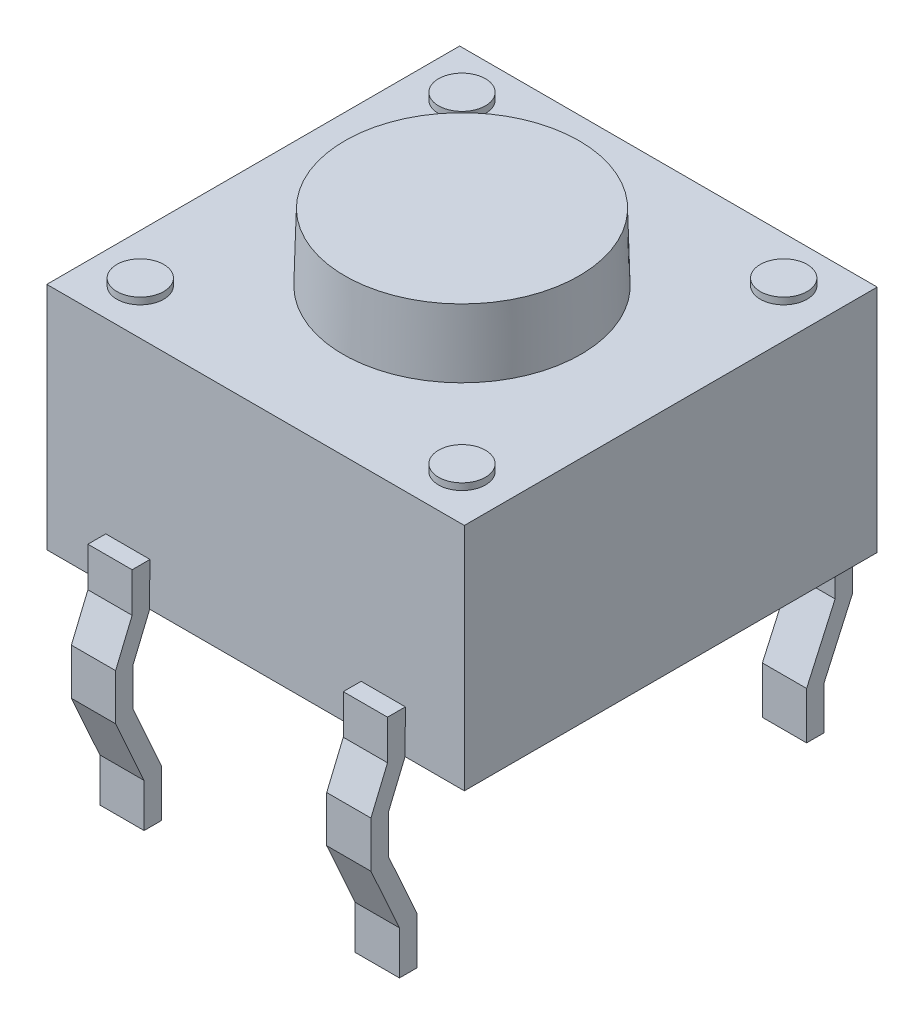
ISO-10303-21;
HEADER;
FILE_DESCRIPTION(('STEP AP214'),'2;1');
FILE_NAME('part.step','',(''),(''),'','','');
FILE_SCHEMA(('AUTOMOTIVE_DESIGN { 1 0 10303 214 1 1 1 1 }'));
ENDSEC;
DATA;
#1=APPLICATION_CONTEXT('core data for automotive mechanical design processes');
#2=APPLICATION_PROTOCOL_DEFINITION('international standard','automotive_design',2000,#1);
#3=PRODUCT_CONTEXT('',#1,'mechanical');
#4=PRODUCT('Part','Part','',(#3));
#5=PRODUCT_RELATED_PRODUCT_CATEGORY('part','',(#4));
#6=PRODUCT_DEFINITION_FORMATION('','',#4);
#7=PRODUCT_DEFINITION_CONTEXT('part definition',#1,'design');
#8=PRODUCT_DEFINITION('design','',#6,#7);
#9=PRODUCT_DEFINITION_SHAPE('','',#8);
#10=(LENGTH_UNIT() NAMED_UNIT(*) SI_UNIT(.MILLI.,.METRE.));
#11=(NAMED_UNIT(*) PLANE_ANGLE_UNIT() SI_UNIT($,.RADIAN.));
#12=(NAMED_UNIT(*) SI_UNIT($,.STERADIAN.) SOLID_ANGLE_UNIT());
#13=UNCERTAINTY_MEASURE_WITH_UNIT(LENGTH_MEASURE(1.E-05),#10,'distance_accuracy_value','');
#14=(GEOMETRIC_REPRESENTATION_CONTEXT(3) GLOBAL_UNCERTAINTY_ASSIGNED_CONTEXT((#13)) GLOBAL_UNIT_ASSIGNED_CONTEXT((#10,
#11,#12)) REPRESENTATION_CONTEXT('',''));
#15=CARTESIAN_POINT('',(0.,0.,0.));
#16=DIRECTION('',(0.,0.,1.));
#17=DIRECTION('',(1.,0.,0.));
#18=AXIS2_PLACEMENT_3D('',#15,#16,#17);
#19=CARTESIAN_POINT('',(-3.115,3.43,-3.08));
#20=DIRECTION('',(0.,-1.,0.));
#21=DIRECTION('',(0.,0.,-1.));
#22=AXIS2_PLACEMENT_3D('',#19,#20,#21);
#23=PLANE('',#22);
#24=CARTESIAN_POINT('',(-2.40002529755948,3.43,2.40002529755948));
#25=DIRECTION('',(0.,-1.,0.));
#26=DIRECTION('',(0.,0.,-1.));
#27=AXIS2_PLACEMENT_3D('',#24,#25,#26);
#28=CIRCLE('',#27,0.350000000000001);
#29=CARTESIAN_POINT('',(-2.40002529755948,3.43,2.05002529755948));
#30=VERTEX_POINT('',#29);
#31=EDGE_CURVE('E64',#30,#30,#28,.F.);
#32=ORIENTED_EDGE('',*,*,#31,.F.);
#33=EDGE_LOOP('',(#32));
#34=FACE_BOUND('',#33,.T.);
#35=CARTESIAN_POINT('',(2.40002529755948,3.43,-2.40002529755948));
#36=DIRECTION('',(0.,-1.,0.));
#37=DIRECTION('',(0.,0.,-1.));
#38=AXIS2_PLACEMENT_3D('',#35,#36,#37);
#39=CIRCLE('',#38,0.350000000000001);
#40=CARTESIAN_POINT('',(2.40002529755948,3.43,-2.75002529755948));
#41=VERTEX_POINT('',#40);
#42=EDGE_CURVE('E940',#41,#41,#39,.F.);
#43=ORIENTED_EDGE('',*,*,#42,.F.);
#44=EDGE_LOOP('',(#43));
#45=FACE_BOUND('',#44,.T.);
#46=DIRECTION('',(0.,0.,1.));
#47=VECTOR('',#46,1.);
#48=CARTESIAN_POINT('',(-3.115,3.43,3.08));
#49=LINE('',#48,#47);
#50=CARTESIAN_POINT('',(-3.115,3.43,-3.08));
#51=VERTEX_POINT('',#50);
#52=CARTESIAN_POINT('',(-3.115,3.43,3.08));
#53=VERTEX_POINT('',#52);
#54=EDGE_CURVE('E916',#51,#53,#49,.T.);
#55=ORIENTED_EDGE('',*,*,#54,.T.);
#56=DIRECTION('',(1.,0.,0.));
#57=VECTOR('',#56,1.);
#58=CARTESIAN_POINT('',(-3.115,3.43,3.08));
#59=LINE('',#58,#57);
#60=CARTESIAN_POINT('',(3.115,3.43,3.08));
#61=VERTEX_POINT('',#60);
#62=EDGE_CURVE('E919',#53,#61,#59,.T.);
#63=ORIENTED_EDGE('',*,*,#62,.T.);
#64=DIRECTION('',(0.,0.,-1.));
#65=VECTOR('',#64,1.);
#66=CARTESIAN_POINT('',(3.115,3.43,3.08));
#67=LINE('',#66,#65);
#68=CARTESIAN_POINT('',(3.115,3.43,-3.08));
#69=VERTEX_POINT('',#68);
#70=EDGE_CURVE('E921',#61,#69,#67,.T.);
#71=ORIENTED_EDGE('',*,*,#70,.T.);
#72=DIRECTION('',(-1.,0.,0.));
#73=VECTOR('',#72,1.);
#74=CARTESIAN_POINT('',(-3.115,3.43,-3.08));
#75=LINE('',#74,#73);
#76=EDGE_CURVE('E923',#69,#51,#75,.T.);
#77=ORIENTED_EDGE('',*,*,#76,.T.);
#78=EDGE_LOOP('',(#55,#63,#71,#77));
#79=FACE_BOUND('',#78,.T.);
#80=CARTESIAN_POINT('',(2.40002529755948,3.43,2.40002529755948));
#81=DIRECTION('',(0.,-1.,0.));
#82=DIRECTION('',(0.,0.,-1.));
#83=AXIS2_PLACEMENT_3D('',#80,#81,#82);
#84=CIRCLE('',#83,0.350000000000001);
#85=CARTESIAN_POINT('',(2.40002529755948,3.43,2.05002529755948));
#86=VERTEX_POINT('',#85);
#87=EDGE_CURVE('E937',#86,#86,#84,.F.);
#88=ORIENTED_EDGE('',*,*,#87,.F.);
#89=EDGE_LOOP('',(#88));
#90=FACE_BOUND('',#89,.T.);
#91=CARTESIAN_POINT('',(-2.40002529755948,3.43,-2.40002529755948));
#92=DIRECTION('',(0.,-1.,0.));
#93=DIRECTION('',(0.,0.,-1.));
#94=AXIS2_PLACEMENT_3D('',#91,#92,#93);
#95=CIRCLE('',#94,0.350000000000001);
#96=CARTESIAN_POINT('',(-2.40002529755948,3.43,-2.75002529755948));
#97=VERTEX_POINT('',#96);
#98=EDGE_CURVE('E943',#97,#97,#95,.F.);
#99=ORIENTED_EDGE('',*,*,#98,.F.);
#100=EDGE_LOOP('',(#99));
#101=FACE_BOUND('',#100,.T.);
#102=CARTESIAN_POINT('',(0.,3.43,0.));
#103=DIRECTION('',(0.,-1.,0.));
#104=DIRECTION('',(0.,0.,-1.));
#105=AXIS2_PLACEMENT_3D('',#102,#103,#104);
#106=CIRCLE('',#105,1.775);
#107=CARTESIAN_POINT('',(0.,3.43,-1.775));
#108=VERTEX_POINT('',#107);
#109=EDGE_CURVE('E12',#108,#108,#106,.F.);
#110=ORIENTED_EDGE('',*,*,#109,.F.);
#111=EDGE_LOOP('',(#110));
#112=FACE_BOUND('',#111,.T.);
#113=ADVANCED_FACE('F56',(#34,#45,#79,#90,#101,#112),#23,.F.);
#114=CARTESIAN_POINT('',(-3.115,3.43,-3.08));
#115=DIRECTION('',(0.,0.,1.));
#116=DIRECTION('',(1.,0.,0.));
#117=AXIS2_PLACEMENT_3D('',#114,#115,#116);
#118=PLANE('',#117);
#119=DIRECTION('',(-1.,0.,0.));
#120=VECTOR('',#119,1.);
#121=CARTESIAN_POINT('',(-3.115,0.,-3.08));
#122=LINE('',#121,#120);
#123=CARTESIAN_POINT('',(3.115,0.,-3.08));
#124=VERTEX_POINT('',#123);
#125=CARTESIAN_POINT('',(-3.115,0.,-3.08));
#126=VERTEX_POINT('',#125);
#127=EDGE_CURVE('E914',#124,#126,#122,.T.);
#128=ORIENTED_EDGE('',*,*,#127,.T.);
#129=DIRECTION('',(0.,-1.,0.));
#130=VECTOR('',#129,1.);
#131=CARTESIAN_POINT('',(-3.115,3.43,-3.08));
#132=LINE('',#131,#130);
#133=EDGE_CURVE('E925',#51,#126,#132,.T.);
#134=ORIENTED_EDGE('',*,*,#133,.F.);
#135=ORIENTED_EDGE('',*,*,#76,.F.);
#136=DIRECTION('',(0.,-1.,0.));
#137=VECTOR('',#136,1.);
#138=CARTESIAN_POINT('',(3.115,3.43,-3.08));
#139=LINE('',#138,#137);
#140=EDGE_CURVE('E928',#69,#124,#139,.T.);
#141=ORIENTED_EDGE('',*,*,#140,.T.);
#142=EDGE_LOOP('',(#128,#134,#135,#141));
#143=FACE_BOUND('',#142,.T.);
#144=DIRECTION('',(-1.,0.,0.));
#145=VECTOR('',#144,1.);
#146=CARTESIAN_POINT('',(1.575,0.645886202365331,-3.08));
#147=LINE('',#146,#145);
#148=CARTESIAN_POINT('',(2.235,0.645886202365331,-3.08));
#149=VERTEX_POINT('',#148);
#150=CARTESIAN_POINT('',(1.575,0.645886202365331,-3.08));
#151=VERTEX_POINT('',#150);
#152=EDGE_CURVE('E587',#149,#151,#147,.T.);
#153=ORIENTED_EDGE('',*,*,#152,.T.);
#154=DIRECTION('',(0.,-1.,0.));
#155=VECTOR('',#154,1.);
#156=CARTESIAN_POINT('',(1.575,0.645886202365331,-3.08));
#157=LINE('',#156,#155);
#158=CARTESIAN_POINT('',(1.575,0.384426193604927,-3.08));
#159=VERTEX_POINT('',#158);
#160=EDGE_CURVE('E584',#151,#159,#157,.T.);
#161=ORIENTED_EDGE('',*,*,#160,.T.);
#162=DIRECTION('',(1.,0.,0.));
#163=VECTOR('',#162,1.);
#164=CARTESIAN_POINT('',(1.575,0.384426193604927,-3.08));
#165=LINE('',#164,#163);
#166=CARTESIAN_POINT('',(2.235,0.384426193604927,-3.08));
#167=VERTEX_POINT('',#166);
#168=EDGE_CURVE('E594',#159,#167,#165,.T.);
#169=ORIENTED_EDGE('',*,*,#168,.T.);
#170=DIRECTION('',(0.,1.,0.));
#171=VECTOR('',#170,1.);
#172=CARTESIAN_POINT('',(2.235,0.645886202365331,-3.08));
#173=LINE('',#172,#171);
#174=EDGE_CURVE('E591',#167,#149,#173,.T.);
#175=ORIENTED_EDGE('',*,*,#174,.T.);
#176=EDGE_LOOP('',(#153,#161,#169,#175));
#177=FACE_BOUND('',#176,.T.);
#178=DIRECTION('',(1.,0.,0.));
#179=VECTOR('',#178,1.);
#180=CARTESIAN_POINT('',(-1.575,0.645886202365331,-3.08));
#181=LINE('',#180,#179);
#182=CARTESIAN_POINT('',(-2.235,0.645886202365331,-3.08));
#183=VERTEX_POINT('',#182);
#184=CARTESIAN_POINT('',(-1.575,0.645886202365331,-3.08));
#185=VERTEX_POINT('',#184);
#186=EDGE_CURVE('E71',#183,#185,#181,.T.);
#187=ORIENTED_EDGE('',*,*,#186,.F.);
#188=DIRECTION('',(0.,1.,0.));
#189=VECTOR('',#188,1.);
#190=CARTESIAN_POINT('',(-2.235,0.645886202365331,-3.08));
#191=LINE('',#190,#189);
#192=CARTESIAN_POINT('',(-2.235,0.384426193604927,-3.08));
#193=VERTEX_POINT('',#192);
#194=EDGE_CURVE('E76',#193,#183,#191,.T.);
#195=ORIENTED_EDGE('',*,*,#194,.F.);
#196=DIRECTION('',(-1.,0.,0.));
#197=VECTOR('',#196,1.);
#198=CARTESIAN_POINT('',(-1.575,0.384426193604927,-3.08));
#199=LINE('',#198,#197);
#200=CARTESIAN_POINT('',(-1.575,0.384426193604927,-3.08));
#201=VERTEX_POINT('',#200);
#202=EDGE_CURVE('E430',#201,#193,#199,.T.);
#203=ORIENTED_EDGE('',*,*,#202,.F.);
#204=DIRECTION('',(0.,-1.,0.));
#205=VECTOR('',#204,1.);
#206=CARTESIAN_POINT('',(-1.575,0.645886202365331,-3.08));
#207=LINE('',#206,#205);
#208=EDGE_CURVE('E434',#185,#201,#207,.T.);
#209=ORIENTED_EDGE('',*,*,#208,.F.);
#210=EDGE_LOOP('',(#187,#195,#203,#209));
#211=FACE_BOUND('',#210,.T.);
#212=ADVANCED_FACE('F432',(#143,#177,#211),#118,.F.);
#213=CARTESIAN_POINT('',(-3.115,3.43,3.08));
#214=DIRECTION('',(0.,0.,-1.));
#215=DIRECTION('',(-1.,0.,0.));
#216=AXIS2_PLACEMENT_3D('',#213,#214,#215);
#217=PLANE('',#216);
#218=DIRECTION('',(1.,0.,0.));
#219=VECTOR('',#218,1.);
#220=CARTESIAN_POINT('',(-1.575,0.645886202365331,3.08));
#221=LINE('',#220,#219);
#222=CARTESIAN_POINT('',(-2.235,0.645886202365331,3.08));
#223=VERTEX_POINT('',#222);
#224=CARTESIAN_POINT('',(-1.575,0.645886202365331,3.08));
#225=VERTEX_POINT('',#224);
#226=EDGE_CURVE('E707',#223,#225,#221,.T.);
#227=ORIENTED_EDGE('',*,*,#226,.T.);
#228=DIRECTION('',(0.,-1.,0.));
#229=VECTOR('',#228,1.);
#230=CARTESIAN_POINT('',(-1.575,0.645886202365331,3.08));
#231=LINE('',#230,#229);
#232=CARTESIAN_POINT('',(-1.575,0.384426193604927,3.08));
#233=VERTEX_POINT('',#232);
#234=EDGE_CURVE('E662',#225,#233,#231,.T.);
#235=ORIENTED_EDGE('',*,*,#234,.T.);
#236=DIRECTION('',(-1.,0.,0.));
#237=VECTOR('',#236,1.);
#238=CARTESIAN_POINT('',(-1.575,0.384426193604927,3.08));
#239=LINE('',#238,#237);
#240=CARTESIAN_POINT('',(-2.235,0.384426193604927,3.08));
#241=VERTEX_POINT('',#240);
#242=EDGE_CURVE('E713',#233,#241,#239,.T.);
#243=ORIENTED_EDGE('',*,*,#242,.T.);
#244=DIRECTION('',(0.,1.,0.));
#245=VECTOR('',#244,1.);
#246=CARTESIAN_POINT('',(-2.235,0.645886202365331,3.08));
#247=LINE('',#246,#245);
#248=EDGE_CURVE('E710',#241,#223,#247,.T.);
#249=ORIENTED_EDGE('',*,*,#248,.T.);
#250=EDGE_LOOP('',(#227,#235,#243,#249));
#251=FACE_BOUND('',#250,.T.);
#252=DIRECTION('',(1.,0.,0.));
#253=VECTOR('',#252,1.);
#254=CARTESIAN_POINT('',(-3.115,0.,3.08));
#255=LINE('',#254,#253);
#256=CARTESIAN_POINT('',(-3.115,0.,3.08));
#257=VERTEX_POINT('',#256);
#258=CARTESIAN_POINT('',(3.115,0.,3.08));
#259=VERTEX_POINT('',#258);
#260=EDGE_CURVE('E910',#257,#259,#255,.T.);
#261=ORIENTED_EDGE('',*,*,#260,.T.);
#262=DIRECTION('',(0.,-1.,0.));
#263=VECTOR('',#262,1.);
#264=CARTESIAN_POINT('',(3.115,3.43,3.08));
#265=LINE('',#264,#263);
#266=EDGE_CURVE('E931',#61,#259,#265,.T.);
#267=ORIENTED_EDGE('',*,*,#266,.F.);
#268=ORIENTED_EDGE('',*,*,#62,.F.);
#269=DIRECTION('',(0.,-1.,0.));
#270=VECTOR('',#269,1.);
#271=CARTESIAN_POINT('',(-3.115,3.43,3.08));
#272=LINE('',#271,#270);
#273=EDGE_CURVE('E934',#53,#257,#272,.T.);
#274=ORIENTED_EDGE('',*,*,#273,.T.);
#275=EDGE_LOOP('',(#261,#267,#268,#274));
#276=FACE_BOUND('',#275,.T.);
#277=DIRECTION('',(-1.,0.,0.));
#278=VECTOR('',#277,1.);
#279=CARTESIAN_POINT('',(1.575,0.645886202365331,3.08));
#280=LINE('',#279,#278);
#281=CARTESIAN_POINT('',(2.235,0.645886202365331,3.08));
#282=VERTEX_POINT('',#281);
#283=CARTESIAN_POINT('',(1.575,0.645886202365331,3.08));
#284=VERTEX_POINT('',#283);
#285=EDGE_CURVE('E835',#282,#284,#280,.T.);
#286=ORIENTED_EDGE('',*,*,#285,.F.);
#287=DIRECTION('',(0.,1.,0.));
#288=VECTOR('',#287,1.);
#289=CARTESIAN_POINT('',(2.235,0.645886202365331,3.08));
#290=LINE('',#289,#288);
#291=CARTESIAN_POINT('',(2.235,0.384426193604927,3.08));
#292=VERTEX_POINT('',#291);
#293=EDGE_CURVE('E832',#292,#282,#290,.T.);
#294=ORIENTED_EDGE('',*,*,#293,.F.);
#295=DIRECTION('',(1.,0.,0.));
#296=VECTOR('',#295,1.);
#297=CARTESIAN_POINT('',(1.575,0.384426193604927,3.08));
#298=LINE('',#297,#296);
#299=CARTESIAN_POINT('',(1.575,0.384426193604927,3.08));
#300=VERTEX_POINT('',#299);
#301=EDGE_CURVE('E829',#300,#292,#298,.T.);
#302=ORIENTED_EDGE('',*,*,#301,.F.);
#303=DIRECTION('',(0.,-1.,0.));
#304=VECTOR('',#303,1.);
#305=CARTESIAN_POINT('',(1.575,0.645886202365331,3.08));
#306=LINE('',#305,#304);
#307=EDGE_CURVE('E781',#284,#300,#306,.T.);
#308=ORIENTED_EDGE('',*,*,#307,.F.);
#309=EDGE_LOOP('',(#286,#294,#302,#308));
#310=FACE_BOUND('',#309,.T.);
#311=ADVANCED_FACE('F1246',(#251,#276,#310),#217,.F.);
#312=CARTESIAN_POINT('',(-3.115,3.43,3.08));
#313=DIRECTION('',(1.,0.,0.));
#314=DIRECTION('',(0.,0.,-1.));
#315=AXIS2_PLACEMENT_3D('',#312,#313,#314);
#316=PLANE('',#315);
#317=DIRECTION('',(0.,0.,1.));
#318=VECTOR('',#317,1.);
#319=CARTESIAN_POINT('',(-3.115,0.,3.08));
#320=LINE('',#319,#318);
#321=EDGE_CURVE('E785',#126,#257,#320,.T.);
#322=ORIENTED_EDGE('',*,*,#321,.T.);
#323=ORIENTED_EDGE('',*,*,#273,.F.);
#324=ORIENTED_EDGE('',*,*,#54,.F.);
#325=ORIENTED_EDGE('',*,*,#133,.T.);
#326=EDGE_LOOP('',(#322,#323,#324,#325));
#327=FACE_BOUND('',#326,.T.);
#328=ADVANCED_FACE('F58',(#327),#316,.F.);
#329=CARTESIAN_POINT('',(3.115,3.43,3.08));
#330=DIRECTION('',(-1.,0.,0.));
#331=DIRECTION('',(0.,0.,1.));
#332=AXIS2_PLACEMENT_3D('',#329,#330,#331);
#333=PLANE('',#332);
#334=DIRECTION('',(0.,0.,-1.));
#335=VECTOR('',#334,1.);
#336=CARTESIAN_POINT('',(3.115,0.,3.08));
#337=LINE('',#336,#335);
#338=EDGE_CURVE('E912',#259,#124,#337,.T.);
#339=ORIENTED_EDGE('',*,*,#338,.T.);
#340=ORIENTED_EDGE('',*,*,#140,.F.);
#341=ORIENTED_EDGE('',*,*,#70,.F.);
#342=ORIENTED_EDGE('',*,*,#266,.T.);
#343=EDGE_LOOP('',(#339,#340,#341,#342));
#344=FACE_BOUND('',#343,.T.);
#345=ADVANCED_FACE('F1241',(#344),#333,.F.);
#346=CARTESIAN_POINT('',(-3.115,0.,-3.08));
#347=DIRECTION('',(0.,-1.,0.));
#348=DIRECTION('',(0.,0.,-1.));
#349=AXIS2_PLACEMENT_3D('',#346,#347,#348);
#350=PLANE('',#349);
#351=ORIENTED_EDGE('',*,*,#321,.F.);
#352=ORIENTED_EDGE('',*,*,#127,.F.);
#353=ORIENTED_EDGE('',*,*,#338,.F.);
#354=ORIENTED_EDGE('',*,*,#260,.F.);
#355=EDGE_LOOP('',(#351,#352,#353,#354));
#356=FACE_BOUND('',#355,.T.);
#357=ADVANCED_FACE('F1235',(#356),#350,.T.);
#358=CARTESIAN_POINT('',(1.575,-2.11005964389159,2.90682182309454));
#359=DIRECTION('',(0.,0.,-1.));
#360=DIRECTION('',(-1.,0.,0.));
#361=AXIS2_PLACEMENT_3D('',#358,#359,#360);
#362=PLANE('',#361);
#363=DIRECTION('',(0.,-1.,0.));
#364=VECTOR('',#363,1.);
#365=CARTESIAN_POINT('',(2.235,-2.11005964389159,2.90682182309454));
#366=LINE('',#365,#364);
#367=CARTESIAN_POINT('',(2.235,-2.11005964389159,2.90682182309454));
#368=VERTEX_POINT('',#367);
#369=CARTESIAN_POINT('',(2.235,-2.81378627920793,2.90682182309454));
#370=VERTEX_POINT('',#369);
#371=EDGE_CURVE('E903',#368,#370,#366,.T.);
#372=ORIENTED_EDGE('',*,*,#371,.T.);
#373=DIRECTION('',(-1.,0.,0.));
#374=VECTOR('',#373,1.);
#375=CARTESIAN_POINT('',(1.575,-2.81378627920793,2.90682182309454));
#376=LINE('',#375,#374);
#377=CARTESIAN_POINT('',(1.575,-2.81378627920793,2.90682182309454));
#378=VERTEX_POINT('',#377);
#379=EDGE_CURVE('E789',#370,#378,#376,.T.);
#380=ORIENTED_EDGE('',*,*,#379,.T.);
#381=DIRECTION('',(0.,-1.,0.));
#382=VECTOR('',#381,1.);
#383=CARTESIAN_POINT('',(1.575,-2.11005964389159,2.90682182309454));
#384=LINE('',#383,#382);
#385=CARTESIAN_POINT('',(1.575,-2.11005964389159,2.90682182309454));
#386=VERTEX_POINT('',#385);
#387=EDGE_CURVE('E800',#386,#378,#384,.T.);
#388=ORIENTED_EDGE('',*,*,#387,.F.);
#389=DIRECTION('',(1.,0.,0.));
#390=VECTOR('',#389,1.);
#391=CARTESIAN_POINT('',(1.575,-2.11005964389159,2.90682182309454));
#392=LINE('',#391,#390);
#393=EDGE_CURVE('E796',#386,#368,#392,.T.);
#394=ORIENTED_EDGE('',*,*,#393,.T.);
#395=EDGE_LOOP('',(#372,#380,#388,#394));
#396=FACE_BOUND('',#395,.T.);
#397=ADVANCED_FACE('F1232',(#396),#362,.T.);
#398=CARTESIAN_POINT('',(1.575,-2.16619332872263,3.16828183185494));
#399=DIRECTION('',(0.,0.,1.));
#400=DIRECTION('',(1.,0.,0.));
#401=AXIS2_PLACEMENT_3D('',#398,#399,#400);
#402=PLANE('',#401);
#403=DIRECTION('',(0.,-1.,0.));
#404=VECTOR('',#403,1.);
#405=CARTESIAN_POINT('',(1.575,-2.16619332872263,3.16828183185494));
#406=LINE('',#405,#404);
#407=CARTESIAN_POINT('',(1.575,-2.16619332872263,3.16828183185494));
#408=VERTEX_POINT('',#407);
#409=CARTESIAN_POINT('',(1.575,-2.81378627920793,3.16828183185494));
#410=VERTEX_POINT('',#409);
#411=EDGE_CURVE('E897',#408,#410,#406,.T.);
#412=ORIENTED_EDGE('',*,*,#411,.T.);
#413=DIRECTION('',(1.,0.,0.));
#414=VECTOR('',#413,1.);
#415=CARTESIAN_POINT('',(1.575,-2.81378627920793,3.16828183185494));
#416=LINE('',#415,#414);
#417=CARTESIAN_POINT('',(2.235,-2.81378627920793,3.16828183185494));
#418=VERTEX_POINT('',#417);
#419=EDGE_CURVE('E782',#410,#418,#416,.T.);
#420=ORIENTED_EDGE('',*,*,#419,.T.);
#421=DIRECTION('',(0.,-1.,0.));
#422=VECTOR('',#421,1.);
#423=CARTESIAN_POINT('',(2.235,-2.16619332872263,3.16828183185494));
#424=LINE('',#423,#422);
#425=CARTESIAN_POINT('',(2.235,-2.16619332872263,3.16828183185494));
#426=VERTEX_POINT('',#425);
#427=EDGE_CURVE('E900',#426,#418,#424,.T.);
#428=ORIENTED_EDGE('',*,*,#427,.F.);
#429=DIRECTION('',(-1.,0.,0.));
#430=VECTOR('',#429,1.);
#431=CARTESIAN_POINT('',(1.575,-2.16619332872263,3.16828183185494));
#432=LINE('',#431,#430);
#433=EDGE_CURVE('E793',#426,#408,#432,.T.);
#434=ORIENTED_EDGE('',*,*,#433,.T.);
#435=EDGE_LOOP('',(#412,#420,#428,#434));
#436=FACE_BOUND('',#435,.T.);
#437=ADVANCED_FACE('F1227',(#436),#402,.T.);
#438=CARTESIAN_POINT('',(1.575,-1.16565595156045,3.33193052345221));
#439=DIRECTION('',(0.,-0.41046668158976,0.911875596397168));
#440=DIRECTION('',(0.,-0.911875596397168,-0.41046668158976));
#441=AXIS2_PLACEMENT_3D('',#438,#439,#440);
#442=PLANE('',#441);
#443=ORIENTED_EDGE('',*,*,#393,.F.);
#444=DIRECTION('',(0.,-0.911875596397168,-0.41046668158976));
#445=VECTOR('',#444,1.);
#446=CARTESIAN_POINT('',(1.575,-1.16565595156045,3.33193052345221));
#447=LINE('',#446,#445);
#448=CARTESIAN_POINT('',(1.575,-1.16565595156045,3.33193052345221));
#449=VERTEX_POINT('',#448);
#450=EDGE_CURVE('E804',#449,#386,#447,.T.);
#451=ORIENTED_EDGE('',*,*,#450,.F.);
#452=DIRECTION('',(-1.,0.,0.));
#453=VECTOR('',#452,1.);
#454=CARTESIAN_POINT('',(1.575,-1.16565595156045,3.33193052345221));
#455=LINE('',#454,#453);
#456=CARTESIAN_POINT('',(2.235,-1.16565595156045,3.33193052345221));
#457=VERTEX_POINT('',#456);
#458=EDGE_CURVE('E805',#457,#449,#455,.T.);
#459=ORIENTED_EDGE('',*,*,#458,.F.);
#460=DIRECTION('',(0.,-0.911875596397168,-0.41046668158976));
#461=VECTOR('',#460,1.);
#462=CARTESIAN_POINT('',(2.235,-1.16565595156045,3.33193052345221));
#463=LINE('',#462,#461);
#464=EDGE_CURVE('E797',#457,#368,#463,.T.);
#465=ORIENTED_EDGE('',*,*,#464,.T.);
#466=EDGE_LOOP('',(#443,#451,#459,#465));
#467=FACE_BOUND('',#466,.T.);
#468=ADVANCED_FACE('F1224',(#467),#442,.F.);
#469=CARTESIAN_POINT('',(1.575,-1.22178963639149,3.59339053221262));
#470=DIRECTION('',(0.,0.41046668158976,-0.911875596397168));
#471=DIRECTION('',(0.,0.911875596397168,0.41046668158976));
#472=AXIS2_PLACEMENT_3D('',#469,#470,#471);
#473=PLANE('',#472);
#474=ORIENTED_EDGE('',*,*,#433,.F.);
#475=DIRECTION('',(0.,-0.911875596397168,-0.41046668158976));
#476=VECTOR('',#475,1.);
#477=CARTESIAN_POINT('',(2.235,-1.22178963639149,3.59339053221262));
#478=LINE('',#477,#476);
#479=CARTESIAN_POINT('',(2.235,-1.22178963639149,3.59339053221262));
#480=VERTEX_POINT('',#479);
#481=EDGE_CURVE('E890',#480,#426,#478,.T.);
#482=ORIENTED_EDGE('',*,*,#481,.F.);
#483=DIRECTION('',(1.,0.,0.));
#484=VECTOR('',#483,1.);
#485=CARTESIAN_POINT('',(1.575,-1.22178963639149,3.59339053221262));
#486=LINE('',#485,#484);
#487=CARTESIAN_POINT('',(1.575,-1.22178963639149,3.59339053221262));
#488=VERTEX_POINT('',#487);
#489=EDGE_CURVE('E801',#488,#480,#486,.T.);
#490=ORIENTED_EDGE('',*,*,#489,.F.);
#491=DIRECTION('',(0.,-0.911875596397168,-0.41046668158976));
#492=VECTOR('',#491,1.);
#493=CARTESIAN_POINT('',(1.575,-1.22178963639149,3.59339053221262));
#494=LINE('',#493,#492);
#495=EDGE_CURVE('E887',#488,#408,#494,.T.);
#496=ORIENTED_EDGE('',*,*,#495,.T.);
#497=EDGE_LOOP('',(#474,#482,#490,#496));
#498=FACE_BOUND('',#497,.T.);
#499=ADVANCED_FACE('F1219',(#498),#473,.F.);
#500=CARTESIAN_POINT('',(1.575,-0.53453060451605,3.59339053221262));
#501=DIRECTION('',(0.,0.,1.));
#502=DIRECTION('',(1.,0.,0.));
#503=AXIS2_PLACEMENT_3D('',#500,#501,#502);
#504=PLANE('',#503);
#505=DIRECTION('',(0.,-1.,0.));
#506=VECTOR('',#505,1.);
#507=CARTESIAN_POINT('',(1.575,-0.53453060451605,3.59339053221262));
#508=LINE('',#507,#506);
#509=CARTESIAN_POINT('',(1.575,-0.53453060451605,3.59339053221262));
#510=VERTEX_POINT('',#509);
#511=EDGE_CURVE('E871',#510,#488,#508,.T.);
#512=ORIENTED_EDGE('',*,*,#511,.T.);
#513=ORIENTED_EDGE('',*,*,#489,.T.);
#514=DIRECTION('',(0.,-1.,0.));
#515=VECTOR('',#514,1.);
#516=CARTESIAN_POINT('',(2.235,-0.53453060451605,3.59339053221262));
#517=LINE('',#516,#515);
#518=CARTESIAN_POINT('',(2.235,-0.53453060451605,3.59339053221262));
#519=VERTEX_POINT('',#518);
#520=EDGE_CURVE('E874',#519,#480,#517,.T.);
#521=ORIENTED_EDGE('',*,*,#520,.F.);
#522=DIRECTION('',(-1.,0.,0.));
#523=VECTOR('',#522,1.);
#524=CARTESIAN_POINT('',(1.575,-0.53453060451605,3.59339053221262));
#525=LINE('',#524,#523);
#526=EDGE_CURVE('E806',#519,#510,#525,.T.);
#527=ORIENTED_EDGE('',*,*,#526,.T.);
#528=EDGE_LOOP('',(#512,#513,#521,#527));
#529=FACE_BOUND('',#528,.T.);
#530=ADVANCED_FACE('F1216',(#529),#504,.T.);
#531=CARTESIAN_POINT('',(1.575,-0.586904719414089,3.33193052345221));
#532=DIRECTION('',(0.,0.,-1.));
#533=DIRECTION('',(-1.,0.,0.));
#534=AXIS2_PLACEMENT_3D('',#531,#532,#533);
#535=PLANE('',#534);
#536=DIRECTION('',(0.,-1.,0.));
#537=VECTOR('',#536,1.);
#538=CARTESIAN_POINT('',(2.235,-0.586904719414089,3.33193052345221));
#539=LINE('',#538,#537);
#540=CARTESIAN_POINT('',(2.235,-0.586904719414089,3.33193052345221));
#541=VERTEX_POINT('',#540);
#542=EDGE_CURVE('E877',#541,#457,#539,.T.);
#543=ORIENTED_EDGE('',*,*,#542,.T.);
#544=ORIENTED_EDGE('',*,*,#458,.T.);
#545=DIRECTION('',(0.,-1.,0.));
#546=VECTOR('',#545,1.);
#547=CARTESIAN_POINT('',(1.575,-0.586904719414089,3.33193052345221));
#548=LINE('',#547,#546);
#549=CARTESIAN_POINT('',(1.575,-0.586904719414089,3.33193052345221));
#550=VERTEX_POINT('',#549);
#551=EDGE_CURVE('E880',#550,#449,#548,.T.);
#552=ORIENTED_EDGE('',*,*,#551,.F.);
#553=DIRECTION('',(1.,0.,0.));
#554=VECTOR('',#553,1.);
#555=CARTESIAN_POINT('',(1.575,-0.586904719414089,3.33193052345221));
#556=LINE('',#555,#554);
#557=EDGE_CURVE('E809',#550,#541,#556,.T.);
#558=ORIENTED_EDGE('',*,*,#557,.T.);
#559=EDGE_LOOP('',(#543,#544,#552,#558));
#560=FACE_BOUND('',#559,.T.);
#561=ADVANCED_FACE('F1211',(#560),#535,.T.);
#562=CARTESIAN_POINT('',(1.575,0.0565481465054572,3.34668867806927));
#563=DIRECTION('',(0.,-0.385172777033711,-0.922844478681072));
#564=DIRECTION('',(0.,0.922844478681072,-0.385172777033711));
#565=AXIS2_PLACEMENT_3D('',#562,#563,#564);
#566=PLANE('',#565);
#567=ORIENTED_EDGE('',*,*,#526,.F.);
#568=DIRECTION('',(0.,-0.922844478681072,0.385172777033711));
#569=VECTOR('',#568,1.);
#570=CARTESIAN_POINT('',(2.235,0.0565481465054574,3.34668867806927));
#571=LINE('',#570,#569);
#572=CARTESIAN_POINT('',(2.235,0.0565481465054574,3.34668867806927));
#573=VERTEX_POINT('',#572);
#574=EDGE_CURVE('E861',#573,#519,#571,.T.);
#575=ORIENTED_EDGE('',*,*,#574,.F.);
#576=DIRECTION('',(1.,0.,0.));
#577=VECTOR('',#576,1.);
#578=CARTESIAN_POINT('',(1.575,0.0565481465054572,3.34668867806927));
#579=LINE('',#578,#577);
#580=CARTESIAN_POINT('',(1.575,0.0565481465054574,3.34668867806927));
#581=VERTEX_POINT('',#580);
#582=EDGE_CURVE('E815',#581,#573,#579,.T.);
#583=ORIENTED_EDGE('',*,*,#582,.F.);
#584=DIRECTION('',(0.,-0.922844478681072,0.385172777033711));
#585=VECTOR('',#584,1.);
#586=CARTESIAN_POINT('',(1.575,0.0565481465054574,3.34668867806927));
#587=LINE('',#586,#585);
#588=EDGE_CURVE('E814',#581,#510,#587,.T.);
#589=ORIENTED_EDGE('',*,*,#588,.T.);
#590=EDGE_LOOP('',(#567,#575,#583,#589));
#591=FACE_BOUND('',#590,.T.);
#592=ADVANCED_FACE('F1208',(#591),#566,.F.);
#593=CARTESIAN_POINT('',(1.575,0.00417403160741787,3.08522866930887));
#594=DIRECTION('',(0.,0.385172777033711,0.922844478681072));
#595=DIRECTION('',(0.,-0.922844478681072,0.385172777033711));
#596=AXIS2_PLACEMENT_3D('',#593,#594,#595);
#597=PLANE('',#596);
#598=ORIENTED_EDGE('',*,*,#557,.F.);
#599=DIRECTION('',(0.,-0.922844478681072,0.385172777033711));
#600=VECTOR('',#599,1.);
#601=CARTESIAN_POINT('',(1.575,0.00417403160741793,3.08522866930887));
#602=LINE('',#601,#600);
#603=CARTESIAN_POINT('',(1.575,0.00417403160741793,3.08522866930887));
#604=VERTEX_POINT('',#603);
#605=EDGE_CURVE('E810',#604,#550,#602,.T.);
#606=ORIENTED_EDGE('',*,*,#605,.F.);
#607=DIRECTION('',(-1.,0.,0.));
#608=VECTOR('',#607,1.);
#609=CARTESIAN_POINT('',(1.575,0.00417403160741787,3.08522866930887));
#610=LINE('',#609,#608);
#611=CARTESIAN_POINT('',(2.235,0.00417403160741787,3.08522866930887));
#612=VERTEX_POINT('',#611);
#613=EDGE_CURVE('E811',#612,#604,#610,.T.);
#614=ORIENTED_EDGE('',*,*,#613,.F.);
#615=DIRECTION('',(0.,-0.922844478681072,0.385172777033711));
#616=VECTOR('',#615,1.);
#617=CARTESIAN_POINT('',(2.235,0.00417403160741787,3.08522866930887));
#618=LINE('',#617,#616);
#619=EDGE_CURVE('E864',#612,#541,#618,.T.);
#620=ORIENTED_EDGE('',*,*,#619,.T.);
#621=EDGE_LOOP('',(#598,#606,#614,#620));
#622=FACE_BOUND('',#621,.T.);
#623=ADVANCED_FACE('F1203',(#622),#597,.F.);
#624=CARTESIAN_POINT('',(1.575,0.645886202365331,3.34668867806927));
#625=DIRECTION('',(0.,0.,1.));
#626=DIRECTION('',(1.,0.,0.));
#627=AXIS2_PLACEMENT_3D('',#624,#625,#626);
#628=PLANE('',#627);
#629=DIRECTION('',(0.,-1.,0.));
#630=VECTOR('',#629,1.);
#631=CARTESIAN_POINT('',(1.575,0.645886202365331,3.34668867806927));
#632=LINE('',#631,#630);
#633=CARTESIAN_POINT('',(1.575,0.645886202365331,3.34668867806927));
#634=VERTEX_POINT('',#633);
#635=EDGE_CURVE('E818',#634,#581,#632,.T.);
#636=ORIENTED_EDGE('',*,*,#635,.T.);
#637=ORIENTED_EDGE('',*,*,#582,.T.);
#638=DIRECTION('',(0.,-1.,0.));
#639=VECTOR('',#638,1.);
#640=CARTESIAN_POINT('',(2.235,0.645886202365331,3.34668867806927));
#641=LINE('',#640,#639);
#642=CARTESIAN_POINT('',(2.235,0.645886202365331,3.34668867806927));
#643=VERTEX_POINT('',#642);
#644=EDGE_CURVE('E826',#643,#573,#641,.T.);
#645=ORIENTED_EDGE('',*,*,#644,.F.);
#646=DIRECTION('',(-1.,0.,0.));
#647=VECTOR('',#646,1.);
#648=CARTESIAN_POINT('',(1.575,0.645886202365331,3.34668867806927));
#649=LINE('',#648,#647);
#650=EDGE_CURVE('E822',#643,#634,#649,.T.);
#651=ORIENTED_EDGE('',*,*,#650,.T.);
#652=EDGE_LOOP('',(#636,#637,#645,#651));
#653=FACE_BOUND('',#652,.T.);
#654=ADVANCED_FACE('F1200',(#653),#628,.T.);
#655=CARTESIAN_POINT('',(1.575,0.384426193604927,3.08522866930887));
#656=DIRECTION('',(0.,0.,-1.));
#657=DIRECTION('',(-1.,0.,0.));
#658=AXIS2_PLACEMENT_3D('',#655,#656,#657);
#659=PLANE('',#658);
#660=DIRECTION('',(0.,-1.,0.));
#661=VECTOR('',#660,1.);
#662=CARTESIAN_POINT('',(2.235,0.384426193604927,3.08522866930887));
#663=LINE('',#662,#661);
#664=CARTESIAN_POINT('',(2.235,0.384426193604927,3.08522866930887));
#665=VERTEX_POINT('',#664);
#666=EDGE_CURVE('E851',#665,#612,#663,.T.);
#667=ORIENTED_EDGE('',*,*,#666,.T.);
#668=ORIENTED_EDGE('',*,*,#613,.T.);
#669=DIRECTION('',(0.,-1.,0.));
#670=VECTOR('',#669,1.);
#671=CARTESIAN_POINT('',(1.575,0.384426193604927,3.08522866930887));
#672=LINE('',#671,#670);
#673=CARTESIAN_POINT('',(1.575,0.384426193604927,3.08522866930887));
#674=VERTEX_POINT('',#673);
#675=EDGE_CURVE('E854',#674,#604,#672,.T.);
#676=ORIENTED_EDGE('',*,*,#675,.F.);
#677=DIRECTION('',(1.,0.,0.));
#678=VECTOR('',#677,1.);
#679=CARTESIAN_POINT('',(1.575,0.384426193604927,3.08522866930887));
#680=LINE('',#679,#678);
#681=EDGE_CURVE('E819',#674,#665,#680,.T.);
#682=ORIENTED_EDGE('',*,*,#681,.T.);
#683=EDGE_LOOP('',(#667,#668,#676,#682));
#684=FACE_BOUND('',#683,.T.);
#685=ADVANCED_FACE('F1188',(#684),#659,.T.);
#686=CARTESIAN_POINT('',(1.575,0.645886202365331,3.92586101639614));
#687=DIRECTION('',(0.,-1.,0.));
#688=DIRECTION('',(0.,0.,-1.));
#689=AXIS2_PLACEMENT_3D('',#686,#687,#688);
#690=PLANE('',#689);
#691=ORIENTED_EDGE('',*,*,#650,.F.);
#692=DIRECTION('',(0.,0.,-1.));
#693=VECTOR('',#692,1.);
#694=CARTESIAN_POINT('',(2.235,0.645886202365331,3.92586101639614));
#695=LINE('',#694,#693);
#696=EDGE_CURVE('E841',#643,#282,#695,.T.);
#697=ORIENTED_EDGE('',*,*,#696,.T.);
#698=ORIENTED_EDGE('',*,*,#285,.T.);
#699=DIRECTION('',(0.,0.,-1.));
#700=VECTOR('',#699,1.);
#701=CARTESIAN_POINT('',(1.575,0.645886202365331,3.92586101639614));
#702=LINE('',#701,#700);
#703=EDGE_CURVE('E838',#634,#284,#702,.T.);
#704=ORIENTED_EDGE('',*,*,#703,.F.);
#705=EDGE_LOOP('',(#691,#697,#698,#704));
#706=FACE_BOUND('',#705,.T.);
#707=ADVANCED_FACE('F1184',(#706),#690,.F.);
#708=CARTESIAN_POINT('',(2.235,0.645886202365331,3.92586101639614));
#709=DIRECTION('',(-1.,0.,0.));
#710=DIRECTION('',(0.,0.,1.));
#711=AXIS2_PLACEMENT_3D('',#708,#709,#710);
#712=PLANE('',#711);
#713=ORIENTED_EDGE('',*,*,#696,.F.);
#714=ORIENTED_EDGE('',*,*,#644,.T.);
#715=ORIENTED_EDGE('',*,*,#574,.T.);
#716=ORIENTED_EDGE('',*,*,#520,.T.);
#717=ORIENTED_EDGE('',*,*,#481,.T.);
#718=ORIENTED_EDGE('',*,*,#427,.T.);
#719=DIRECTION('',(0.,0.,-1.));
#720=VECTOR('',#719,1.);
#721=CARTESIAN_POINT('',(2.235,-2.81378627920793,3.5364957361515));
#722=LINE('',#721,#720);
#723=EDGE_CURVE('E792',#418,#370,#722,.T.);
#724=ORIENTED_EDGE('',*,*,#723,.T.);
#725=ORIENTED_EDGE('',*,*,#371,.F.);
#726=ORIENTED_EDGE('',*,*,#464,.F.);
#727=ORIENTED_EDGE('',*,*,#542,.F.);
#728=ORIENTED_EDGE('',*,*,#619,.F.);
#729=ORIENTED_EDGE('',*,*,#666,.F.);
#730=DIRECTION('',(0.,0.,-1.));
#731=VECTOR('',#730,1.);
#732=CARTESIAN_POINT('',(2.235,0.384426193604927,3.92586101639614));
#733=LINE('',#732,#731);
#734=EDGE_CURVE('E844',#665,#292,#733,.T.);
#735=ORIENTED_EDGE('',*,*,#734,.T.);
#736=ORIENTED_EDGE('',*,*,#293,.T.);
#737=EDGE_LOOP('',(#713,#714,#715,#716,#717,#718,#724,#725,#726,#727,#728,#729,#735,#736));
#738=FACE_BOUND('',#737,.T.);
#739=ADVANCED_FACE('F1187',(#738),#712,.F.);
#740=CARTESIAN_POINT('',(1.575,0.384426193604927,3.92586101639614));
#741=DIRECTION('',(0.,1.,0.));
#742=DIRECTION('',(0.,0.,1.));
#743=AXIS2_PLACEMENT_3D('',#740,#741,#742);
#744=PLANE('',#743);
#745=ORIENTED_EDGE('',*,*,#681,.F.);
#746=DIRECTION('',(0.,0.,-1.));
#747=VECTOR('',#746,1.);
#748=CARTESIAN_POINT('',(1.575,0.384426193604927,3.92586101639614));
#749=LINE('',#748,#747);
#750=EDGE_CURVE('E823',#674,#300,#749,.T.);
#751=ORIENTED_EDGE('',*,*,#750,.T.);
#752=ORIENTED_EDGE('',*,*,#301,.T.);
#753=ORIENTED_EDGE('',*,*,#734,.F.);
#754=EDGE_LOOP('',(#745,#751,#752,#753));
#755=FACE_BOUND('',#754,.T.);
#756=ADVANCED_FACE('F1192',(#755),#744,.F.);
#757=CARTESIAN_POINT('',(1.575,0.645886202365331,3.92586101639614));
#758=DIRECTION('',(1.,0.,0.));
#759=DIRECTION('',(0.,0.,-1.));
#760=AXIS2_PLACEMENT_3D('',#757,#758,#759);
#761=PLANE('',#760);
#762=ORIENTED_EDGE('',*,*,#750,.F.);
#763=ORIENTED_EDGE('',*,*,#675,.T.);
#764=ORIENTED_EDGE('',*,*,#605,.T.);
#765=ORIENTED_EDGE('',*,*,#551,.T.);
#766=ORIENTED_EDGE('',*,*,#450,.T.);
#767=ORIENTED_EDGE('',*,*,#387,.T.);
#768=DIRECTION('',(0.,0.,1.));
#769=VECTOR('',#768,1.);
#770=CARTESIAN_POINT('',(1.575,-2.81378627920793,3.5364957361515));
#771=LINE('',#770,#769);
#772=EDGE_CURVE('E786',#378,#410,#771,.T.);
#773=ORIENTED_EDGE('',*,*,#772,.T.);
#774=ORIENTED_EDGE('',*,*,#411,.F.);
#775=ORIENTED_EDGE('',*,*,#495,.F.);
#776=ORIENTED_EDGE('',*,*,#511,.F.);
#777=ORIENTED_EDGE('',*,*,#588,.F.);
#778=ORIENTED_EDGE('',*,*,#635,.F.);
#779=ORIENTED_EDGE('',*,*,#703,.T.);
#780=ORIENTED_EDGE('',*,*,#307,.T.);
#781=EDGE_LOOP('',(#762,#763,#764,#765,#766,#767,#773,#774,#775,#776,#777,#778,#779,#780));
#782=FACE_BOUND('',#781,.T.);
#783=ADVANCED_FACE('F1182',(#782),#761,.F.);
#784=CARTESIAN_POINT('',(1.905,-2.81378627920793,3.03755182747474));
#785=DIRECTION('',(0.,-1.,0.));
#786=DIRECTION('',(0.,0.,-1.));
#787=AXIS2_PLACEMENT_3D('',#784,#785,#786);
#788=PLANE('',#787);
#789=ORIENTED_EDGE('',*,*,#723,.F.);
#790=ORIENTED_EDGE('',*,*,#419,.F.);
#791=ORIENTED_EDGE('',*,*,#772,.F.);
#792=ORIENTED_EDGE('',*,*,#379,.F.);
#793=EDGE_LOOP('',(#789,#790,#791,#792));
#794=FACE_BOUND('',#793,.T.);
#795=ADVANCED_FACE('F1175',(#794),#788,.T.);
#796=CARTESIAN_POINT('',(-1.575,-2.11005964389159,2.90682182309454));
#797=DIRECTION('',(0.,0.,1.));
#798=DIRECTION('',(1.,0.,0.));
#799=AXIS2_PLACEMENT_3D('',#796,#797,#798);
#800=PLANE('',#799);
#801=DIRECTION('',(1.,0.,0.));
#802=VECTOR('',#801,1.);
#803=CARTESIAN_POINT('',(-1.575,-2.81378627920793,2.90682182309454));
#804=LINE('',#803,#802);
#805=CARTESIAN_POINT('',(-2.235,-2.81378627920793,2.90682182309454));
#806=VERTEX_POINT('',#805);
#807=CARTESIAN_POINT('',(-1.575,-2.81378627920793,2.90682182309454));
#808=VERTEX_POINT('',#807);
#809=EDGE_CURVE('E665',#806,#808,#804,.T.);
#810=ORIENTED_EDGE('',*,*,#809,.F.);
#811=DIRECTION('',(0.,-1.,0.));
#812=VECTOR('',#811,1.);
#813=CARTESIAN_POINT('',(-2.235,-2.11005964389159,2.90682182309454));
#814=LINE('',#813,#812);
#815=CARTESIAN_POINT('',(-2.235,-2.11005964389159,2.90682182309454));
#816=VERTEX_POINT('',#815);
#817=EDGE_CURVE('E772',#816,#806,#814,.T.);
#818=ORIENTED_EDGE('',*,*,#817,.F.);
#819=DIRECTION('',(-1.,0.,0.));
#820=VECTOR('',#819,1.);
#821=CARTESIAN_POINT('',(-1.575,-2.11005964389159,2.90682182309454));
#822=LINE('',#821,#820);
#823=CARTESIAN_POINT('',(-1.575,-2.11005964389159,2.90682182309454));
#824=VERTEX_POINT('',#823);
#825=EDGE_CURVE('E675',#824,#816,#822,.T.);
#826=ORIENTED_EDGE('',*,*,#825,.F.);
#827=DIRECTION('',(0.,-1.,0.));
#828=VECTOR('',#827,1.);
#829=CARTESIAN_POINT('',(-1.575,-2.11005964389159,2.90682182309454));
#830=LINE('',#829,#828);
#831=EDGE_CURVE('E674',#824,#808,#830,.T.);
#832=ORIENTED_EDGE('',*,*,#831,.T.);
#833=EDGE_LOOP('',(#810,#818,#826,#832));
#834=FACE_BOUND('',#833,.T.);
#835=ADVANCED_FACE('F1172',(#834),#800,.F.);
#836=CARTESIAN_POINT('',(-1.575,-2.16619332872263,3.16828183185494));
#837=DIRECTION('',(0.,0.,-1.));
#838=DIRECTION('',(-1.,0.,0.));
#839=AXIS2_PLACEMENT_3D('',#836,#837,#838);
#840=PLANE('',#839);
#841=DIRECTION('',(-1.,0.,0.));
#842=VECTOR('',#841,1.);
#843=CARTESIAN_POINT('',(-1.575,-2.81378627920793,3.16828183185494));
#844=LINE('',#843,#842);
#845=CARTESIAN_POINT('',(-1.575,-2.81378627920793,3.16828183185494));
#846=VERTEX_POINT('',#845);
#847=CARTESIAN_POINT('',(-2.235,-2.81378627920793,3.16828183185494));
#848=VERTEX_POINT('',#847);
#849=EDGE_CURVE('E670',#846,#848,#844,.T.);
#850=ORIENTED_EDGE('',*,*,#849,.F.);
#851=DIRECTION('',(0.,-1.,0.));
#852=VECTOR('',#851,1.);
#853=CARTESIAN_POINT('',(-1.575,-2.16619332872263,3.16828183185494));
#854=LINE('',#853,#852);
#855=CARTESIAN_POINT('',(-1.575,-2.16619332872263,3.16828183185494));
#856=VERTEX_POINT('',#855);
#857=EDGE_CURVE('E666',#856,#846,#854,.T.);
#858=ORIENTED_EDGE('',*,*,#857,.F.);
#859=DIRECTION('',(1.,0.,0.));
#860=VECTOR('',#859,1.);
#861=CARTESIAN_POINT('',(-1.575,-2.16619332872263,3.16828183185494));
#862=LINE('',#861,#860);
#863=CARTESIAN_POINT('',(-2.235,-2.16619332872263,3.16828183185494));
#864=VERTEX_POINT('',#863);
#865=EDGE_CURVE('E671',#864,#856,#862,.T.);
#866=ORIENTED_EDGE('',*,*,#865,.F.);
#867=DIRECTION('',(0.,-1.,0.));
#868=VECTOR('',#867,1.);
#869=CARTESIAN_POINT('',(-2.235,-2.16619332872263,3.16828183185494));
#870=LINE('',#869,#868);
#871=EDGE_CURVE('E775',#864,#848,#870,.T.);
#872=ORIENTED_EDGE('',*,*,#871,.T.);
#873=EDGE_LOOP('',(#850,#858,#866,#872));
#874=FACE_BOUND('',#873,.T.);
#875=ADVANCED_FACE('F1167',(#874),#840,.F.);
#876=CARTESIAN_POINT('',(-1.575,-1.16565595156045,3.33193052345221));
#877=DIRECTION('',(0.,0.41046668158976,-0.911875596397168));
#878=DIRECTION('',(0.,0.911875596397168,0.41046668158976));
#879=AXIS2_PLACEMENT_3D('',#876,#877,#878);
#880=PLANE('',#879);
#881=DIRECTION('',(0.,-0.911875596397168,-0.41046668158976));
#882=VECTOR('',#881,1.);
#883=CARTESIAN_POINT('',(-1.575,-1.16565595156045,3.33193052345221));
#884=LINE('',#883,#882);
#885=CARTESIAN_POINT('',(-1.575,-1.16565595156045,3.33193052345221));
#886=VERTEX_POINT('',#885);
#887=EDGE_CURVE('E678',#886,#824,#884,.T.);
#888=ORIENTED_EDGE('',*,*,#887,.T.);
#889=ORIENTED_EDGE('',*,*,#825,.T.);
#890=DIRECTION('',(0.,-0.911875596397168,-0.41046668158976));
#891=VECTOR('',#890,1.);
#892=CARTESIAN_POINT('',(-2.235,-1.16565595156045,3.33193052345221));
#893=LINE('',#892,#891);
#894=CARTESIAN_POINT('',(-2.235,-1.16565595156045,3.33193052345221));
#895=VERTEX_POINT('',#894);
#896=EDGE_CURVE('E686',#895,#816,#893,.T.);
#897=ORIENTED_EDGE('',*,*,#896,.F.);
#898=DIRECTION('',(1.,0.,0.));
#899=VECTOR('',#898,1.);
#900=CARTESIAN_POINT('',(-1.575,-1.16565595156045,3.33193052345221));
#901=LINE('',#900,#899);
#902=EDGE_CURVE('E682',#895,#886,#901,.T.);
#903=ORIENTED_EDGE('',*,*,#902,.T.);
#904=EDGE_LOOP('',(#888,#889,#897,#903));
#905=FACE_BOUND('',#904,.T.);
#906=ADVANCED_FACE('F1164',(#905),#880,.T.);
#907=CARTESIAN_POINT('',(-1.575,-1.22178963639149,3.59339053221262));
#908=DIRECTION('',(0.,-0.41046668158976,0.911875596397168));
#909=DIRECTION('',(0.,-0.911875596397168,-0.41046668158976));
#910=AXIS2_PLACEMENT_3D('',#907,#908,#909);
#911=PLANE('',#910);
#912=DIRECTION('',(0.,-0.911875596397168,-0.41046668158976));
#913=VECTOR('',#912,1.);
#914=CARTESIAN_POINT('',(-2.235,-1.22178963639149,3.59339053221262));
#915=LINE('',#914,#913);
#916=CARTESIAN_POINT('',(-2.235,-1.22178963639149,3.59339053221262));
#917=VERTEX_POINT('',#916);
#918=EDGE_CURVE('E762',#917,#864,#915,.T.);
#919=ORIENTED_EDGE('',*,*,#918,.T.);
#920=ORIENTED_EDGE('',*,*,#865,.T.);
#921=DIRECTION('',(0.,-0.911875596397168,-0.41046668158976));
#922=VECTOR('',#921,1.);
#923=CARTESIAN_POINT('',(-1.575,-1.22178963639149,3.59339053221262));
#924=LINE('',#923,#922);
#925=CARTESIAN_POINT('',(-1.575,-1.22178963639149,3.59339053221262));
#926=VERTEX_POINT('',#925);
#927=EDGE_CURVE('E765',#926,#856,#924,.T.);
#928=ORIENTED_EDGE('',*,*,#927,.F.);
#929=DIRECTION('',(-1.,0.,0.));
#930=VECTOR('',#929,1.);
#931=CARTESIAN_POINT('',(-1.575,-1.22178963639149,3.59339053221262));
#932=LINE('',#931,#930);
#933=EDGE_CURVE('E679',#926,#917,#932,.T.);
#934=ORIENTED_EDGE('',*,*,#933,.T.);
#935=EDGE_LOOP('',(#919,#920,#928,#934));
#936=FACE_BOUND('',#935,.T.);
#937=ADVANCED_FACE('F1159',(#936),#911,.T.);
#938=CARTESIAN_POINT('',(-1.575,-0.586904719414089,3.33193052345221));
#939=DIRECTION('',(0.,0.,1.));
#940=DIRECTION('',(1.,0.,0.));
#941=AXIS2_PLACEMENT_3D('',#938,#939,#940);
#942=PLANE('',#941);
#943=ORIENTED_EDGE('',*,*,#902,.F.);
#944=DIRECTION('',(0.,-1.,0.));
#945=VECTOR('',#944,1.);
#946=CARTESIAN_POINT('',(-2.235,-0.586904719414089,3.33193052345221));
#947=LINE('',#946,#945);
#948=CARTESIAN_POINT('',(-2.235,-0.586904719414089,3.33193052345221));
#949=VERTEX_POINT('',#948);
#950=EDGE_CURVE('E690',#949,#895,#947,.T.);
#951=ORIENTED_EDGE('',*,*,#950,.F.);
#952=DIRECTION('',(-1.,0.,0.));
#953=VECTOR('',#952,1.);
#954=CARTESIAN_POINT('',(-1.575,-0.586904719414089,3.33193052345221));
#955=LINE('',#954,#953);
#956=CARTESIAN_POINT('',(-1.575,-0.586904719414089,3.33193052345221));
#957=VERTEX_POINT('',#956);
#958=EDGE_CURVE('E691',#957,#949,#955,.T.);
#959=ORIENTED_EDGE('',*,*,#958,.F.);
#960=DIRECTION('',(0.,-1.,0.));
#961=VECTOR('',#960,1.);
#962=CARTESIAN_POINT('',(-1.575,-0.586904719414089,3.33193052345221));
#963=LINE('',#962,#961);
#964=EDGE_CURVE('E683',#957,#886,#963,.T.);
#965=ORIENTED_EDGE('',*,*,#964,.T.);
#966=EDGE_LOOP('',(#943,#951,#959,#965));
#967=FACE_BOUND('',#966,.T.);
#968=ADVANCED_FACE('F1156',(#967),#942,.F.);
#969=CARTESIAN_POINT('',(-1.575,-0.53453060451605,3.59339053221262));
#970=DIRECTION('',(0.,0.,-1.));
#971=DIRECTION('',(-1.,0.,0.));
#972=AXIS2_PLACEMENT_3D('',#969,#970,#971);
#973=PLANE('',#972);
#974=ORIENTED_EDGE('',*,*,#933,.F.);
#975=DIRECTION('',(0.,-1.,0.));
#976=VECTOR('',#975,1.);
#977=CARTESIAN_POINT('',(-1.575,-0.53453060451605,3.59339053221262));
#978=LINE('',#977,#976);
#979=CARTESIAN_POINT('',(-1.575,-0.53453060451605,3.59339053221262));
#980=VERTEX_POINT('',#979);
#981=EDGE_CURVE('E755',#980,#926,#978,.T.);
#982=ORIENTED_EDGE('',*,*,#981,.F.);
#983=DIRECTION('',(1.,0.,0.));
#984=VECTOR('',#983,1.);
#985=CARTESIAN_POINT('',(-1.575,-0.53453060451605,3.59339053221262));
#986=LINE('',#985,#984);
#987=CARTESIAN_POINT('',(-2.235,-0.53453060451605,3.59339053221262));
#988=VERTEX_POINT('',#987);
#989=EDGE_CURVE('E687',#988,#980,#986,.T.);
#990=ORIENTED_EDGE('',*,*,#989,.F.);
#991=DIRECTION('',(0.,-1.,0.));
#992=VECTOR('',#991,1.);
#993=CARTESIAN_POINT('',(-2.235,-0.53453060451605,3.59339053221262));
#994=LINE('',#993,#992);
#995=EDGE_CURVE('E752',#988,#917,#994,.T.);
#996=ORIENTED_EDGE('',*,*,#995,.T.);
#997=EDGE_LOOP('',(#974,#982,#990,#996));
#998=FACE_BOUND('',#997,.T.);
#999=ADVANCED_FACE('F1151',(#998),#973,.F.);
#1000=CARTESIAN_POINT('',(-1.575,0.0565481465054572,3.34668867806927));
#1001=DIRECTION('',(0.,0.385172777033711,0.922844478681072));
#1002=DIRECTION('',(0.,-0.922844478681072,0.385172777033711));
#1003=AXIS2_PLACEMENT_3D('',#1000,#1001,#1002);
#1004=PLANE('',#1003);
#1005=DIRECTION('',(0.,-0.922844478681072,0.385172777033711));
#1006=VECTOR('',#1005,1.);
#1007=CARTESIAN_POINT('',(-2.235,0.0565481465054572,3.34668867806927));
#1008=LINE('',#1007,#1006);
#1009=CARTESIAN_POINT('',(-2.235,0.0565481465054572,3.34668867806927));
#1010=VERTEX_POINT('',#1009);
#1011=EDGE_CURVE('E736',#1010,#988,#1008,.T.);
#1012=ORIENTED_EDGE('',*,*,#1011,.T.);
#1013=ORIENTED_EDGE('',*,*,#989,.T.);
#1014=DIRECTION('',(0.,-0.922844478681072,0.385172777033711));
#1015=VECTOR('',#1014,1.);
#1016=CARTESIAN_POINT('',(-1.575,0.0565481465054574,3.34668867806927));
#1017=LINE('',#1016,#1015);
#1018=CARTESIAN_POINT('',(-1.575,0.0565481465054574,3.34668867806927));
#1019=VERTEX_POINT('',#1018);
#1020=EDGE_CURVE('E739',#1019,#980,#1017,.T.);
#1021=ORIENTED_EDGE('',*,*,#1020,.F.);
#1022=DIRECTION('',(-1.,0.,0.));
#1023=VECTOR('',#1022,1.);
#1024=CARTESIAN_POINT('',(-1.575,0.0565481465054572,3.34668867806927));
#1025=LINE('',#1024,#1023);
#1026=EDGE_CURVE('E692',#1019,#1010,#1025,.T.);
#1027=ORIENTED_EDGE('',*,*,#1026,.T.);
#1028=EDGE_LOOP('',(#1012,#1013,#1021,#1027));
#1029=FACE_BOUND('',#1028,.T.);
#1030=ADVANCED_FACE('F1148',(#1029),#1004,.T.);
#1031=CARTESIAN_POINT('',(-1.575,0.00417403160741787,3.08522866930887));
#1032=DIRECTION('',(0.,-0.385172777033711,-0.922844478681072));
#1033=DIRECTION('',(0.,0.922844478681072,-0.385172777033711));
#1034=AXIS2_PLACEMENT_3D('',#1031,#1032,#1033);
#1035=PLANE('',#1034);
#1036=DIRECTION('',(0.,-0.922844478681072,0.385172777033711));
#1037=VECTOR('',#1036,1.);
#1038=CARTESIAN_POINT('',(-1.575,0.00417403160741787,3.08522866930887));
#1039=LINE('',#1038,#1037);
#1040=CARTESIAN_POINT('',(-1.575,0.00417403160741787,3.08522866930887));
#1041=VERTEX_POINT('',#1040);
#1042=EDGE_CURVE('E742',#1041,#957,#1039,.T.);
#1043=ORIENTED_EDGE('',*,*,#1042,.T.);
#1044=ORIENTED_EDGE('',*,*,#958,.T.);
#1045=DIRECTION('',(0.,-0.922844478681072,0.385172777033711));
#1046=VECTOR('',#1045,1.);
#1047=CARTESIAN_POINT('',(-2.235,0.00417403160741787,3.08522866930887));
#1048=LINE('',#1047,#1046);
#1049=CARTESIAN_POINT('',(-2.235,0.00417403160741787,3.08522866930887));
#1050=VERTEX_POINT('',#1049);
#1051=EDGE_CURVE('E745',#1050,#949,#1048,.T.);
#1052=ORIENTED_EDGE('',*,*,#1051,.F.);
#1053=DIRECTION('',(1.,0.,0.));
#1054=VECTOR('',#1053,1.);
#1055=CARTESIAN_POINT('',(-1.575,0.00417403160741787,3.08522866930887));
#1056=LINE('',#1055,#1054);
#1057=EDGE_CURVE('E695',#1050,#1041,#1056,.T.);
#1058=ORIENTED_EDGE('',*,*,#1057,.T.);
#1059=EDGE_LOOP('',(#1043,#1044,#1052,#1058));
#1060=FACE_BOUND('',#1059,.T.);
#1061=ADVANCED_FACE('F1143',(#1060),#1035,.T.);
#1062=CARTESIAN_POINT('',(-1.575,0.645886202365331,3.34668867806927));
#1063=DIRECTION('',(0.,0.,-1.));
#1064=DIRECTION('',(-1.,0.,0.));
#1065=AXIS2_PLACEMENT_3D('',#1062,#1063,#1064);
#1066=PLANE('',#1065);
#1067=ORIENTED_EDGE('',*,*,#1026,.F.);
#1068=DIRECTION('',(0.,-1.,0.));
#1069=VECTOR('',#1068,1.);
#1070=CARTESIAN_POINT('',(-1.575,0.645886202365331,3.34668867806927));
#1071=LINE('',#1070,#1069);
#1072=CARTESIAN_POINT('',(-1.575,0.645886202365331,3.34668867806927));
#1073=VERTEX_POINT('',#1072);
#1074=EDGE_CURVE('E726',#1073,#1019,#1071,.T.);
#1075=ORIENTED_EDGE('',*,*,#1074,.F.);
#1076=DIRECTION('',(1.,0.,0.));
#1077=VECTOR('',#1076,1.);
#1078=CARTESIAN_POINT('',(-1.575,0.645886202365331,3.34668867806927));
#1079=LINE('',#1078,#1077);
#1080=CARTESIAN_POINT('',(-2.235,0.645886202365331,3.34668867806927));
#1081=VERTEX_POINT('',#1080);
#1082=EDGE_CURVE('E700',#1081,#1073,#1079,.T.);
#1083=ORIENTED_EDGE('',*,*,#1082,.F.);
#1084=DIRECTION('',(0.,-1.,0.));
#1085=VECTOR('',#1084,1.);
#1086=CARTESIAN_POINT('',(-2.235,0.645886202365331,3.34668867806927));
#1087=LINE('',#1086,#1085);
#1088=EDGE_CURVE('E704',#1081,#1010,#1087,.T.);
#1089=ORIENTED_EDGE('',*,*,#1088,.T.);
#1090=EDGE_LOOP('',(#1067,#1075,#1083,#1089));
#1091=FACE_BOUND('',#1090,.T.);
#1092=ADVANCED_FACE('F1140',(#1091),#1066,.F.);
#1093=CARTESIAN_POINT('',(-1.575,0.384426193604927,3.08522866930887));
#1094=DIRECTION('',(0.,0.,1.));
#1095=DIRECTION('',(1.,0.,0.));
#1096=AXIS2_PLACEMENT_3D('',#1093,#1094,#1095);
#1097=PLANE('',#1096);
#1098=ORIENTED_EDGE('',*,*,#1057,.F.);
#1099=DIRECTION('',(0.,-1.,0.));
#1100=VECTOR('',#1099,1.);
#1101=CARTESIAN_POINT('',(-2.235,0.384426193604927,3.08522866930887));
#1102=LINE('',#1101,#1100);
#1103=CARTESIAN_POINT('',(-2.235,0.384426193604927,3.08522866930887));
#1104=VERTEX_POINT('',#1103);
#1105=EDGE_CURVE('E696',#1104,#1050,#1102,.T.);
#1106=ORIENTED_EDGE('',*,*,#1105,.F.);
#1107=DIRECTION('',(-1.,0.,0.));
#1108=VECTOR('',#1107,1.);
#1109=CARTESIAN_POINT('',(-1.575,0.384426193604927,3.08522866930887));
#1110=LINE('',#1109,#1108);
#1111=CARTESIAN_POINT('',(-1.575,0.384426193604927,3.08522866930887));
#1112=VERTEX_POINT('',#1111);
#1113=EDGE_CURVE('E697',#1112,#1104,#1110,.T.);
#1114=ORIENTED_EDGE('',*,*,#1113,.F.);
#1115=DIRECTION('',(0.,-1.,0.));
#1116=VECTOR('',#1115,1.);
#1117=CARTESIAN_POINT('',(-1.575,0.384426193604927,3.08522866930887));
#1118=LINE('',#1117,#1116);
#1119=EDGE_CURVE('E729',#1112,#1041,#1118,.T.);
#1120=ORIENTED_EDGE('',*,*,#1119,.T.);
#1121=EDGE_LOOP('',(#1098,#1106,#1114,#1120));
#1122=FACE_BOUND('',#1121,.T.);
#1123=ADVANCED_FACE('F1138',(#1122),#1097,.F.);
#1124=CARTESIAN_POINT('',(-1.575,0.645886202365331,3.92586101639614));
#1125=DIRECTION('',(1.,0.,0.));
#1126=DIRECTION('',(0.,0.,-1.));
#1127=AXIS2_PLACEMENT_3D('',#1124,#1125,#1126);
#1128=PLANE('',#1127);
#1129=DIRECTION('',(0.,0.,-1.));
#1130=VECTOR('',#1129,1.);
#1131=CARTESIAN_POINT('',(-1.575,0.645886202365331,3.92586101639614));
#1132=LINE('',#1131,#1130);
#1133=EDGE_CURVE('E701',#1073,#225,#1132,.T.);
#1134=ORIENTED_EDGE('',*,*,#1133,.F.);
#1135=ORIENTED_EDGE('',*,*,#1074,.T.);
#1136=ORIENTED_EDGE('',*,*,#1020,.T.);
#1137=ORIENTED_EDGE('',*,*,#981,.T.);
#1138=ORIENTED_EDGE('',*,*,#927,.T.);
#1139=ORIENTED_EDGE('',*,*,#857,.T.);
#1140=DIRECTION('',(0.,0.,1.));
#1141=VECTOR('',#1140,1.);
#1142=CARTESIAN_POINT('',(-1.575,-2.81378627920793,3.5364957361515));
#1143=LINE('',#1142,#1141);
#1144=EDGE_CURVE('E668',#808,#846,#1143,.T.);
#1145=ORIENTED_EDGE('',*,*,#1144,.F.);
#1146=ORIENTED_EDGE('',*,*,#831,.F.);
#1147=ORIENTED_EDGE('',*,*,#887,.F.);
#1148=ORIENTED_EDGE('',*,*,#964,.F.);
#1149=ORIENTED_EDGE('',*,*,#1042,.F.);
#1150=ORIENTED_EDGE('',*,*,#1119,.F.);
#1151=DIRECTION('',(0.,0.,-1.));
#1152=VECTOR('',#1151,1.);
#1153=CARTESIAN_POINT('',(-1.575,0.384426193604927,3.92586101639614));
#1154=LINE('',#1153,#1152);
#1155=EDGE_CURVE('E716',#1112,#233,#1154,.T.);
#1156=ORIENTED_EDGE('',*,*,#1155,.T.);
#1157=ORIENTED_EDGE('',*,*,#234,.F.);
#1158=EDGE_LOOP('',(#1134,#1135,#1136,#1137,#1138,#1139,#1145,#1146,#1147,#1148,#1149,#1150,
#1156,#1157));
#1159=FACE_BOUND('',#1158,.T.);
#1160=ADVANCED_FACE('F1128',(#1159),#1128,.T.);
#1161=CARTESIAN_POINT('',(-1.575,0.384426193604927,3.92586101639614));
#1162=DIRECTION('',(0.,-1.,0.));
#1163=DIRECTION('',(0.,0.,-1.));
#1164=AXIS2_PLACEMENT_3D('',#1161,#1162,#1163);
#1165=PLANE('',#1164);
#1166=ORIENTED_EDGE('',*,*,#1155,.F.);
#1167=ORIENTED_EDGE('',*,*,#1113,.T.);
#1168=DIRECTION('',(0.,0.,-1.));
#1169=VECTOR('',#1168,1.);
#1170=CARTESIAN_POINT('',(-2.235,0.384426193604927,3.92586101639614));
#1171=LINE('',#1170,#1169);
#1172=EDGE_CURVE('E718',#1104,#241,#1171,.T.);
#1173=ORIENTED_EDGE('',*,*,#1172,.T.);
#1174=ORIENTED_EDGE('',*,*,#242,.F.);
#1175=EDGE_LOOP('',(#1166,#1167,#1173,#1174));
#1176=FACE_BOUND('',#1175,.T.);
#1177=ADVANCED_FACE('F1124',(#1176),#1165,.T.);
#1178=CARTESIAN_POINT('',(-2.235,0.645886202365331,3.92586101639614));
#1179=DIRECTION('',(-1.,0.,0.));
#1180=DIRECTION('',(0.,0.,1.));
#1181=AXIS2_PLACEMENT_3D('',#1178,#1179,#1180);
#1182=PLANE('',#1181);
#1183=ORIENTED_EDGE('',*,*,#1172,.F.);
#1184=ORIENTED_EDGE('',*,*,#1105,.T.);
#1185=ORIENTED_EDGE('',*,*,#1051,.T.);
#1186=ORIENTED_EDGE('',*,*,#950,.T.);
#1187=ORIENTED_EDGE('',*,*,#896,.T.);
#1188=ORIENTED_EDGE('',*,*,#817,.T.);
#1189=DIRECTION('',(0.,0.,-1.));
#1190=VECTOR('',#1189,1.);
#1191=CARTESIAN_POINT('',(-2.235,-2.81378627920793,3.5364957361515));
#1192=LINE('',#1191,#1190);
#1193=EDGE_CURVE('E663',#848,#806,#1192,.T.);
#1194=ORIENTED_EDGE('',*,*,#1193,.F.);
#1195=ORIENTED_EDGE('',*,*,#871,.F.);
#1196=ORIENTED_EDGE('',*,*,#918,.F.);
#1197=ORIENTED_EDGE('',*,*,#995,.F.);
#1198=ORIENTED_EDGE('',*,*,#1011,.F.);
#1199=ORIENTED_EDGE('',*,*,#1088,.F.);
#1200=DIRECTION('',(0.,0.,-1.));
#1201=VECTOR('',#1200,1.);
#1202=CARTESIAN_POINT('',(-2.235,0.645886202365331,3.92586101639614));
#1203=LINE('',#1202,#1201);
#1204=EDGE_CURVE('E720',#1081,#223,#1203,.T.);
#1205=ORIENTED_EDGE('',*,*,#1204,.T.);
#1206=ORIENTED_EDGE('',*,*,#248,.F.);
#1207=EDGE_LOOP('',(#1183,#1184,#1185,#1186,#1187,#1188,#1194,#1195,#1196,#1197,#1198,#1199,
#1205,#1206));
#1208=FACE_BOUND('',#1207,.T.);
#1209=ADVANCED_FACE('F1127',(#1208),#1182,.T.);
#1210=CARTESIAN_POINT('',(-1.575,0.645886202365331,3.92586101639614));
#1211=DIRECTION('',(0.,1.,0.));
#1212=DIRECTION('',(0.,0.,1.));
#1213=AXIS2_PLACEMENT_3D('',#1210,#1211,#1212);
#1214=PLANE('',#1213);
#1215=ORIENTED_EDGE('',*,*,#1204,.F.);
#1216=ORIENTED_EDGE('',*,*,#1082,.T.);
#1217=ORIENTED_EDGE('',*,*,#1133,.T.);
#1218=ORIENTED_EDGE('',*,*,#226,.F.);
#1219=EDGE_LOOP('',(#1215,#1216,#1217,#1218));
#1220=FACE_BOUND('',#1219,.T.);
#1221=ADVANCED_FACE('F1122',(#1220),#1214,.T.);
#1222=CARTESIAN_POINT('',(-1.905,-2.81378627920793,3.03755182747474));
#1223=DIRECTION('',(0.,-1.,0.));
#1224=DIRECTION('',(0.,0.,-1.));
#1225=AXIS2_PLACEMENT_3D('',#1222,#1223,#1224);
#1226=PLANE('',#1225);
#1227=ORIENTED_EDGE('',*,*,#1144,.T.);
#1228=ORIENTED_EDGE('',*,*,#849,.T.);
#1229=ORIENTED_EDGE('',*,*,#1193,.T.);
#1230=ORIENTED_EDGE('',*,*,#809,.T.);
#1231=EDGE_LOOP('',(#1227,#1228,#1229,#1230));
#1232=FACE_BOUND('',#1231,.T.);
#1233=ADVANCED_FACE('F1115',(#1232),#1226,.T.);
#1234=CARTESIAN_POINT('',(1.575,-2.11005964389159,-2.90682182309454));
#1235=DIRECTION('',(0.,0.,-1.));
#1236=DIRECTION('',(-1.,0.,0.));
#1237=AXIS2_PLACEMENT_3D('',#1234,#1235,#1236);
#1238=PLANE('',#1237);
#1239=DIRECTION('',(-1.,0.,0.));
#1240=VECTOR('',#1239,1.);
#1241=CARTESIAN_POINT('',(1.575,-2.81378627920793,-2.90682182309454));
#1242=LINE('',#1241,#1240);
#1243=CARTESIAN_POINT('',(2.235,-2.81378627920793,-2.90682182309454));
#1244=VERTEX_POINT('',#1243);
#1245=CARTESIAN_POINT('',(1.575,-2.81378627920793,-2.90682182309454));
#1246=VERTEX_POINT('',#1245);
#1247=EDGE_CURVE('E544',#1244,#1246,#1242,.T.);
#1248=ORIENTED_EDGE('',*,*,#1247,.F.);
#1249=DIRECTION('',(0.,-1.,0.));
#1250=VECTOR('',#1249,1.);
#1251=CARTESIAN_POINT('',(2.235,-2.11005964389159,-2.90682182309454));
#1252=LINE('',#1251,#1250);
#1253=CARTESIAN_POINT('',(2.235,-2.11005964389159,-2.90682182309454));
#1254=VERTEX_POINT('',#1253);
#1255=EDGE_CURVE('E653',#1254,#1244,#1252,.T.);
#1256=ORIENTED_EDGE('',*,*,#1255,.F.);
#1257=DIRECTION('',(1.,0.,0.));
#1258=VECTOR('',#1257,1.);
#1259=CARTESIAN_POINT('',(1.575,-2.11005964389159,-2.90682182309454));
#1260=LINE('',#1259,#1258);
#1261=CARTESIAN_POINT('',(1.575,-2.11005964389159,-2.90682182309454));
#1262=VERTEX_POINT('',#1261);
#1263=EDGE_CURVE('E554',#1262,#1254,#1260,.T.);
#1264=ORIENTED_EDGE('',*,*,#1263,.F.);
#1265=DIRECTION('',(0.,-1.,0.));
#1266=VECTOR('',#1265,1.);
#1267=CARTESIAN_POINT('',(1.575,-2.11005964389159,-2.90682182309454));
#1268=LINE('',#1267,#1266);
#1269=EDGE_CURVE('E553',#1262,#1246,#1268,.T.);
#1270=ORIENTED_EDGE('',*,*,#1269,.T.);
#1271=EDGE_LOOP('',(#1248,#1256,#1264,#1270));
#1272=FACE_BOUND('',#1271,.T.);
#1273=ADVANCED_FACE('F1112',(#1272),#1238,.F.);
#1274=CARTESIAN_POINT('',(1.575,-2.16619332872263,-3.16828183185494));
#1275=DIRECTION('',(0.,0.,1.));
#1276=DIRECTION('',(1.,0.,0.));
#1277=AXIS2_PLACEMENT_3D('',#1274,#1275,#1276);
#1278=PLANE('',#1277);
#1279=DIRECTION('',(1.,0.,0.));
#1280=VECTOR('',#1279,1.);
#1281=CARTESIAN_POINT('',(1.575,-2.81378627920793,-3.16828183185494));
#1282=LINE('',#1281,#1280);
#1283=CARTESIAN_POINT('',(1.575,-2.81378627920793,-3.16828183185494));
#1284=VERTEX_POINT('',#1283);
#1285=CARTESIAN_POINT('',(2.235,-2.81378627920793,-3.16828183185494));
#1286=VERTEX_POINT('',#1285);
#1287=EDGE_CURVE('E549',#1284,#1286,#1282,.T.);
#1288=ORIENTED_EDGE('',*,*,#1287,.F.);
#1289=DIRECTION('',(0.,-1.,0.));
#1290=VECTOR('',#1289,1.);
#1291=CARTESIAN_POINT('',(1.575,-2.16619332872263,-3.16828183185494));
#1292=LINE('',#1291,#1290);
#1293=CARTESIAN_POINT('',(1.575,-2.16619332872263,-3.16828183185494));
#1294=VERTEX_POINT('',#1293);
#1295=EDGE_CURVE('E545',#1294,#1284,#1292,.T.);
#1296=ORIENTED_EDGE('',*,*,#1295,.F.);
#1297=DIRECTION('',(-1.,0.,0.));
#1298=VECTOR('',#1297,1.);
#1299=CARTESIAN_POINT('',(1.575,-2.16619332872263,-3.16828183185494));
#1300=LINE('',#1299,#1298);
#1301=CARTESIAN_POINT('',(2.235,-2.16619332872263,-3.16828183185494));
#1302=VERTEX_POINT('',#1301);
#1303=EDGE_CURVE('E550',#1302,#1294,#1300,.T.);
#1304=ORIENTED_EDGE('',*,*,#1303,.F.);
#1305=DIRECTION('',(0.,-1.,0.));
#1306=VECTOR('',#1305,1.);
#1307=CARTESIAN_POINT('',(2.235,-2.16619332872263,-3.16828183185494));
#1308=LINE('',#1307,#1306);
#1309=EDGE_CURVE('E656',#1302,#1286,#1308,.T.);
#1310=ORIENTED_EDGE('',*,*,#1309,.T.);
#1311=EDGE_LOOP('',(#1288,#1296,#1304,#1310));
#1312=FACE_BOUND('',#1311,.T.);
#1313=ADVANCED_FACE('F1107',(#1312),#1278,.F.);
#1314=CARTESIAN_POINT('',(1.575,-1.16565595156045,-3.33193052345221));
#1315=DIRECTION('',(0.,0.41046668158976,0.911875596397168));
#1316=DIRECTION('',(0.,-0.911875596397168,0.41046668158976));
#1317=AXIS2_PLACEMENT_3D('',#1314,#1315,#1316);
#1318=PLANE('',#1317);
#1319=DIRECTION('',(0.,-0.911875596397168,0.41046668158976));
#1320=VECTOR('',#1319,1.);
#1321=CARTESIAN_POINT('',(1.575,-1.16565595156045,-3.33193052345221));
#1322=LINE('',#1321,#1320);
#1323=CARTESIAN_POINT('',(1.575,-1.16565595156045,-3.33193052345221));
#1324=VERTEX_POINT('',#1323);
#1325=EDGE_CURVE('E557',#1324,#1262,#1322,.T.);
#1326=ORIENTED_EDGE('',*,*,#1325,.T.);
#1327=ORIENTED_EDGE('',*,*,#1263,.T.);
#1328=DIRECTION('',(0.,-0.911875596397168,0.41046668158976));
#1329=VECTOR('',#1328,1.);
#1330=CARTESIAN_POINT('',(2.235,-1.16565595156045,-3.33193052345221));
#1331=LINE('',#1330,#1329);
#1332=CARTESIAN_POINT('',(2.235,-1.16565595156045,-3.33193052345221));
#1333=VERTEX_POINT('',#1332);
#1334=EDGE_CURVE('E565',#1333,#1254,#1331,.T.);
#1335=ORIENTED_EDGE('',*,*,#1334,.F.);
#1336=DIRECTION('',(-1.,0.,0.));
#1337=VECTOR('',#1336,1.);
#1338=CARTESIAN_POINT('',(1.575,-1.16565595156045,-3.33193052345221));
#1339=LINE('',#1338,#1337);
#1340=EDGE_CURVE('E561',#1333,#1324,#1339,.T.);
#1341=ORIENTED_EDGE('',*,*,#1340,.T.);
#1342=EDGE_LOOP('',(#1326,#1327,#1335,#1341));
#1343=FACE_BOUND('',#1342,.T.);
#1344=ADVANCED_FACE('F1104',(#1343),#1318,.T.);
#1345=CARTESIAN_POINT('',(1.575,-1.22178963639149,-3.59339053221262));
#1346=DIRECTION('',(0.,-0.41046668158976,-0.911875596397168));
#1347=DIRECTION('',(0.,0.911875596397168,-0.41046668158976));
#1348=AXIS2_PLACEMENT_3D('',#1345,#1346,#1347);
#1349=PLANE('',#1348);
#1350=DIRECTION('',(0.,-0.911875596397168,0.41046668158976));
#1351=VECTOR('',#1350,1.);
#1352=CARTESIAN_POINT('',(2.235,-1.22178963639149,-3.59339053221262));
#1353=LINE('',#1352,#1351);
#1354=CARTESIAN_POINT('',(2.235,-1.22178963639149,-3.59339053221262));
#1355=VERTEX_POINT('',#1354);
#1356=EDGE_CURVE('E643',#1355,#1302,#1353,.T.);
#1357=ORIENTED_EDGE('',*,*,#1356,.T.);
#1358=ORIENTED_EDGE('',*,*,#1303,.T.);
#1359=DIRECTION('',(0.,-0.911875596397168,0.41046668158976));
#1360=VECTOR('',#1359,1.);
#1361=CARTESIAN_POINT('',(1.575,-1.22178963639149,-3.59339053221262));
#1362=LINE('',#1361,#1360);
#1363=CARTESIAN_POINT('',(1.575,-1.22178963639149,-3.59339053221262));
#1364=VERTEX_POINT('',#1363);
#1365=EDGE_CURVE('E646',#1364,#1294,#1362,.T.);
#1366=ORIENTED_EDGE('',*,*,#1365,.F.);
#1367=DIRECTION('',(1.,0.,0.));
#1368=VECTOR('',#1367,1.);
#1369=CARTESIAN_POINT('',(1.575,-1.22178963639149,-3.59339053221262));
#1370=LINE('',#1369,#1368);
#1371=EDGE_CURVE('E558',#1364,#1355,#1370,.T.);
#1372=ORIENTED_EDGE('',*,*,#1371,.T.);
#1373=EDGE_LOOP('',(#1357,#1358,#1366,#1372));
#1374=FACE_BOUND('',#1373,.T.);
#1375=ADVANCED_FACE('F1099',(#1374),#1349,.T.);
#1376=CARTESIAN_POINT('',(1.575,-0.586904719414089,-3.33193052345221));
#1377=DIRECTION('',(0.,0.,-1.));
#1378=DIRECTION('',(-1.,0.,0.));
#1379=AXIS2_PLACEMENT_3D('',#1376,#1377,#1378);
#1380=PLANE('',#1379);
#1381=ORIENTED_EDGE('',*,*,#1340,.F.);
#1382=DIRECTION('',(0.,-1.,0.));
#1383=VECTOR('',#1382,1.);
#1384=CARTESIAN_POINT('',(2.235,-0.586904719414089,-3.33193052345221));
#1385=LINE('',#1384,#1383);
#1386=CARTESIAN_POINT('',(2.235,-0.586904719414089,-3.33193052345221));
#1387=VERTEX_POINT('',#1386);
#1388=EDGE_CURVE('E569',#1387,#1333,#1385,.T.);
#1389=ORIENTED_EDGE('',*,*,#1388,.F.);
#1390=DIRECTION('',(1.,0.,0.));
#1391=VECTOR('',#1390,1.);
#1392=CARTESIAN_POINT('',(1.575,-0.586904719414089,-3.33193052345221));
#1393=LINE('',#1392,#1391);
#1394=CARTESIAN_POINT('',(1.575,-0.586904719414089,-3.33193052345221));
#1395=VERTEX_POINT('',#1394);
#1396=EDGE_CURVE('E570',#1395,#1387,#1393,.T.);
#1397=ORIENTED_EDGE('',*,*,#1396,.F.);
#1398=DIRECTION('',(0.,-1.,0.));
#1399=VECTOR('',#1398,1.);
#1400=CARTESIAN_POINT('',(1.575,-0.586904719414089,-3.33193052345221));
#1401=LINE('',#1400,#1399);
#1402=EDGE_CURVE('E562',#1395,#1324,#1401,.T.);
#1403=ORIENTED_EDGE('',*,*,#1402,.T.);
#1404=EDGE_LOOP('',(#1381,#1389,#1397,#1403));
#1405=FACE_BOUND('',#1404,.T.);
#1406=ADVANCED_FACE('F1096',(#1405),#1380,.F.);
#1407=CARTESIAN_POINT('',(1.575,-0.53453060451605,-3.59339053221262));
#1408=DIRECTION('',(0.,0.,1.));
#1409=DIRECTION('',(1.,0.,0.));
#1410=AXIS2_PLACEMENT_3D('',#1407,#1408,#1409);
#1411=PLANE('',#1410);
#1412=ORIENTED_EDGE('',*,*,#1371,.F.);
#1413=DIRECTION('',(0.,-1.,0.));
#1414=VECTOR('',#1413,1.);
#1415=CARTESIAN_POINT('',(1.575,-0.53453060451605,-3.59339053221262));
#1416=LINE('',#1415,#1414);
#1417=CARTESIAN_POINT('',(1.575,-0.53453060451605,-3.59339053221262));
#1418=VERTEX_POINT('',#1417);
#1419=EDGE_CURVE('E636',#1418,#1364,#1416,.T.);
#1420=ORIENTED_EDGE('',*,*,#1419,.F.);
#1421=DIRECTION('',(-1.,0.,0.));
#1422=VECTOR('',#1421,1.);
#1423=CARTESIAN_POINT('',(1.575,-0.53453060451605,-3.59339053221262));
#1424=LINE('',#1423,#1422);
#1425=CARTESIAN_POINT('',(2.235,-0.53453060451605,-3.59339053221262));
#1426=VERTEX_POINT('',#1425);
#1427=EDGE_CURVE('E566',#1426,#1418,#1424,.T.);
#1428=ORIENTED_EDGE('',*,*,#1427,.F.);
#1429=DIRECTION('',(0.,-1.,0.));
#1430=VECTOR('',#1429,1.);
#1431=CARTESIAN_POINT('',(2.235,-0.53453060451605,-3.59339053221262));
#1432=LINE('',#1431,#1430);
#1433=EDGE_CURVE('E633',#1426,#1355,#1432,.T.);
#1434=ORIENTED_EDGE('',*,*,#1433,.T.);
#1435=EDGE_LOOP('',(#1412,#1420,#1428,#1434));
#1436=FACE_BOUND('',#1435,.T.);
#1437=ADVANCED_FACE('F1091',(#1436),#1411,.F.);
#1438=CARTESIAN_POINT('',(1.575,0.0565481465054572,-3.34668867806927));
#1439=DIRECTION('',(0.,0.385172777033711,-0.922844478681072));
#1440=DIRECTION('',(0.,0.922844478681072,0.385172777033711));
#1441=AXIS2_PLACEMENT_3D('',#1438,#1439,#1440);
#1442=PLANE('',#1441);
#1443=DIRECTION('',(0.,-0.922844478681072,-0.385172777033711));
#1444=VECTOR('',#1443,1.);
#1445=CARTESIAN_POINT('',(2.235,0.0565481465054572,-3.34668867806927));
#1446=LINE('',#1445,#1444);
#1447=CARTESIAN_POINT('',(2.235,0.0565481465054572,-3.34668867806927));
#1448=VERTEX_POINT('',#1447);
#1449=EDGE_CURVE('E617',#1448,#1426,#1446,.T.);
#1450=ORIENTED_EDGE('',*,*,#1449,.T.);
#1451=ORIENTED_EDGE('',*,*,#1427,.T.);
#1452=DIRECTION('',(0.,-0.922844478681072,-0.385172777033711));
#1453=VECTOR('',#1452,1.);
#1454=CARTESIAN_POINT('',(1.575,0.0565481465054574,-3.34668867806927));
#1455=LINE('',#1454,#1453);
#1456=CARTESIAN_POINT('',(1.575,0.0565481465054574,-3.34668867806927));
#1457=VERTEX_POINT('',#1456);
#1458=EDGE_CURVE('E620',#1457,#1418,#1455,.T.);
#1459=ORIENTED_EDGE('',*,*,#1458,.F.);
#1460=DIRECTION('',(1.,0.,0.));
#1461=VECTOR('',#1460,1.);
#1462=CARTESIAN_POINT('',(1.575,0.0565481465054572,-3.34668867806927));
#1463=LINE('',#1462,#1461);
#1464=EDGE_CURVE('E571',#1457,#1448,#1463,.T.);
#1465=ORIENTED_EDGE('',*,*,#1464,.T.);
#1466=EDGE_LOOP('',(#1450,#1451,#1459,#1465));
#1467=FACE_BOUND('',#1466,.T.);
#1468=ADVANCED_FACE('F1088',(#1467),#1442,.T.);
#1469=CARTESIAN_POINT('',(1.575,0.00417403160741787,-3.08522866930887));
#1470=DIRECTION('',(0.,-0.385172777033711,0.922844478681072));
#1471=DIRECTION('',(0.,-0.922844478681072,-0.385172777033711));
#1472=AXIS2_PLACEMENT_3D('',#1469,#1470,#1471);
#1473=PLANE('',#1472);
#1474=DIRECTION('',(0.,-0.922844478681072,-0.385172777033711));
#1475=VECTOR('',#1474,1.);
#1476=CARTESIAN_POINT('',(1.575,0.00417403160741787,-3.08522866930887));
#1477=LINE('',#1476,#1475);
#1478=CARTESIAN_POINT('',(1.575,0.00417403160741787,-3.08522866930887));
#1479=VERTEX_POINT('',#1478);
#1480=EDGE_CURVE('E623',#1479,#1395,#1477,.T.);
#1481=ORIENTED_EDGE('',*,*,#1480,.T.);
#1482=ORIENTED_EDGE('',*,*,#1396,.T.);
#1483=DIRECTION('',(0.,-0.922844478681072,-0.385172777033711));
#1484=VECTOR('',#1483,1.);
#1485=CARTESIAN_POINT('',(2.235,0.00417403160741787,-3.08522866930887));
#1486=LINE('',#1485,#1484);
#1487=CARTESIAN_POINT('',(2.235,0.00417403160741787,-3.08522866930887));
#1488=VERTEX_POINT('',#1487);
#1489=EDGE_CURVE('E626',#1488,#1387,#1486,.T.);
#1490=ORIENTED_EDGE('',*,*,#1489,.F.);
#1491=DIRECTION('',(-1.,0.,0.));
#1492=VECTOR('',#1491,1.);
#1493=CARTESIAN_POINT('',(1.575,0.00417403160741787,-3.08522866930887));
#1494=LINE('',#1493,#1492);
#1495=EDGE_CURVE('E574',#1488,#1479,#1494,.T.);
#1496=ORIENTED_EDGE('',*,*,#1495,.T.);
#1497=EDGE_LOOP('',(#1481,#1482,#1490,#1496));
#1498=FACE_BOUND('',#1497,.T.);
#1499=ADVANCED_FACE('F1083',(#1498),#1473,.T.);
#1500=CARTESIAN_POINT('',(1.575,0.645886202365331,-3.34668867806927));
#1501=DIRECTION('',(0.,0.,1.));
#1502=DIRECTION('',(1.,0.,0.));
#1503=AXIS2_PLACEMENT_3D('',#1500,#1501,#1502);
#1504=PLANE('',#1503);
#1505=ORIENTED_EDGE('',*,*,#1464,.F.);
#1506=DIRECTION('',(0.,-1.,0.));
#1507=VECTOR('',#1506,1.);
#1508=CARTESIAN_POINT('',(1.575,0.645886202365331,-3.34668867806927));
#1509=LINE('',#1508,#1507);
#1510=CARTESIAN_POINT('',(1.575,0.645886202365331,-3.34668867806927));
#1511=VERTEX_POINT('',#1510);
#1512=EDGE_CURVE('E607',#1511,#1457,#1509,.T.);
#1513=ORIENTED_EDGE('',*,*,#1512,.F.);
#1514=DIRECTION('',(-1.,0.,0.));
#1515=VECTOR('',#1514,1.);
#1516=CARTESIAN_POINT('',(1.575,0.645886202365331,-3.34668867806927));
#1517=LINE('',#1516,#1515);
#1518=CARTESIAN_POINT('',(2.235,0.645886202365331,-3.34668867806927));
#1519=VERTEX_POINT('',#1518);
#1520=EDGE_CURVE('E579',#1519,#1511,#1517,.T.);
#1521=ORIENTED_EDGE('',*,*,#1520,.F.);
#1522=DIRECTION('',(0.,-1.,0.));
#1523=VECTOR('',#1522,1.);
#1524=CARTESIAN_POINT('',(2.235,0.645886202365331,-3.34668867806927));
#1525=LINE('',#1524,#1523);
#1526=EDGE_CURVE('E583',#1519,#1448,#1525,.T.);
#1527=ORIENTED_EDGE('',*,*,#1526,.T.);
#1528=EDGE_LOOP('',(#1505,#1513,#1521,#1527));
#1529=FACE_BOUND('',#1528,.T.);
#1530=ADVANCED_FACE('F1080',(#1529),#1504,.F.);
#1531=CARTESIAN_POINT('',(1.575,0.384426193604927,-3.08522866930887));
#1532=DIRECTION('',(0.,0.,-1.));
#1533=DIRECTION('',(-1.,0.,0.));
#1534=AXIS2_PLACEMENT_3D('',#1531,#1532,#1533);
#1535=PLANE('',#1534);
#1536=ORIENTED_EDGE('',*,*,#1495,.F.);
#1537=DIRECTION('',(0.,-1.,0.));
#1538=VECTOR('',#1537,1.);
#1539=CARTESIAN_POINT('',(2.235,0.384426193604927,-3.08522866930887));
#1540=LINE('',#1539,#1538);
#1541=CARTESIAN_POINT('',(2.235,0.384426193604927,-3.08522866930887));
#1542=VERTEX_POINT('',#1541);
#1543=EDGE_CURVE('E575',#1542,#1488,#1540,.T.);
#1544=ORIENTED_EDGE('',*,*,#1543,.F.);
#1545=DIRECTION('',(1.,0.,0.));
#1546=VECTOR('',#1545,1.);
#1547=CARTESIAN_POINT('',(1.575,0.384426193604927,-3.08522866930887));
#1548=LINE('',#1547,#1546);
#1549=CARTESIAN_POINT('',(1.575,0.384426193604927,-3.08522866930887));
#1550=VERTEX_POINT('',#1549);
#1551=EDGE_CURVE('E576',#1550,#1542,#1548,.T.);
#1552=ORIENTED_EDGE('',*,*,#1551,.F.);
#1553=DIRECTION('',(0.,-1.,0.));
#1554=VECTOR('',#1553,1.);
#1555=CARTESIAN_POINT('',(1.575,0.384426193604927,-3.08522866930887));
#1556=LINE('',#1555,#1554);
#1557=EDGE_CURVE('E610',#1550,#1479,#1556,.T.);
#1558=ORIENTED_EDGE('',*,*,#1557,.T.);
#1559=EDGE_LOOP('',(#1536,#1544,#1552,#1558));
#1560=FACE_BOUND('',#1559,.T.);
#1561=ADVANCED_FACE('F1078',(#1560),#1535,.F.);
#1562=CARTESIAN_POINT('',(1.575,0.645886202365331,-3.92586101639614));
#1563=DIRECTION('',(-1.,0.,0.));
#1564=DIRECTION('',(0.,0.,1.));
#1565=AXIS2_PLACEMENT_3D('',#1562,#1563,#1564);
#1566=PLANE('',#1565);
#1567=DIRECTION('',(0.,0.,1.));
#1568=VECTOR('',#1567,1.);
#1569=CARTESIAN_POINT('',(1.575,0.645886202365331,-3.92586101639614));
#1570=LINE('',#1569,#1568);
#1571=EDGE_CURVE('E580',#1511,#151,#1570,.T.);
#1572=ORIENTED_EDGE('',*,*,#1571,.F.);
#1573=ORIENTED_EDGE('',*,*,#1512,.T.);
#1574=ORIENTED_EDGE('',*,*,#1458,.T.);
#1575=ORIENTED_EDGE('',*,*,#1419,.T.);
#1576=ORIENTED_EDGE('',*,*,#1365,.T.);
#1577=ORIENTED_EDGE('',*,*,#1295,.T.);
#1578=DIRECTION('',(0.,0.,-1.));
#1579=VECTOR('',#1578,1.);
#1580=CARTESIAN_POINT('',(1.575,-2.81378627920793,-3.5364957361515));
#1581=LINE('',#1580,#1579);
#1582=EDGE_CURVE('E547',#1246,#1284,#1581,.T.);
#1583=ORIENTED_EDGE('',*,*,#1582,.F.);
#1584=ORIENTED_EDGE('',*,*,#1269,.F.);
#1585=ORIENTED_EDGE('',*,*,#1325,.F.);
#1586=ORIENTED_EDGE('',*,*,#1402,.F.);
#1587=ORIENTED_EDGE('',*,*,#1480,.F.);
#1588=ORIENTED_EDGE('',*,*,#1557,.F.);
#1589=DIRECTION('',(0.,0.,1.));
#1590=VECTOR('',#1589,1.);
#1591=CARTESIAN_POINT('',(1.575,0.384426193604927,-3.92586101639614));
#1592=LINE('',#1591,#1590);
#1593=EDGE_CURVE('E597',#1550,#159,#1592,.T.);
#1594=ORIENTED_EDGE('',*,*,#1593,.T.);
#1595=ORIENTED_EDGE('',*,*,#160,.F.);
#1596=EDGE_LOOP('',(#1572,#1573,#1574,#1575,#1576,#1577,#1583,#1584,#1585,#1586,#1587,#1588,
#1594,#1595));
#1597=FACE_BOUND('',#1596,.T.);
#1598=ADVANCED_FACE('F1068',(#1597),#1566,.T.);
#1599=CARTESIAN_POINT('',(1.575,0.384426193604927,-3.92586101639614));
#1600=DIRECTION('',(0.,-1.,0.));
#1601=DIRECTION('',(0.,0.,-1.));
#1602=AXIS2_PLACEMENT_3D('',#1599,#1600,#1601);
#1603=PLANE('',#1602);
#1604=ORIENTED_EDGE('',*,*,#1593,.F.);
#1605=ORIENTED_EDGE('',*,*,#1551,.T.);
#1606=DIRECTION('',(0.,0.,1.));
#1607=VECTOR('',#1606,1.);
#1608=CARTESIAN_POINT('',(2.235,0.384426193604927,-3.92586101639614));
#1609=LINE('',#1608,#1607);
#1610=EDGE_CURVE('E599',#1542,#167,#1609,.T.);
#1611=ORIENTED_EDGE('',*,*,#1610,.T.);
#1612=ORIENTED_EDGE('',*,*,#168,.F.);
#1613=EDGE_LOOP('',(#1604,#1605,#1611,#1612));
#1614=FACE_BOUND('',#1613,.T.);
#1615=ADVANCED_FACE('F1064',(#1614),#1603,.T.);
#1616=CARTESIAN_POINT('',(2.235,0.645886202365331,-3.92586101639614));
#1617=DIRECTION('',(1.,0.,0.));
#1618=DIRECTION('',(0.,0.,-1.));
#1619=AXIS2_PLACEMENT_3D('',#1616,#1617,#1618);
#1620=PLANE('',#1619);
#1621=ORIENTED_EDGE('',*,*,#1610,.F.);
#1622=ORIENTED_EDGE('',*,*,#1543,.T.);
#1623=ORIENTED_EDGE('',*,*,#1489,.T.);
#1624=ORIENTED_EDGE('',*,*,#1388,.T.);
#1625=ORIENTED_EDGE('',*,*,#1334,.T.);
#1626=ORIENTED_EDGE('',*,*,#1255,.T.);
#1627=DIRECTION('',(0.,0.,1.));
#1628=VECTOR('',#1627,1.);
#1629=CARTESIAN_POINT('',(2.235,-2.81378627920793,-3.5364957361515));
#1630=LINE('',#1629,#1628);
#1631=EDGE_CURVE('E542',#1286,#1244,#1630,.T.);
#1632=ORIENTED_EDGE('',*,*,#1631,.F.);
#1633=ORIENTED_EDGE('',*,*,#1309,.F.);
#1634=ORIENTED_EDGE('',*,*,#1356,.F.);
#1635=ORIENTED_EDGE('',*,*,#1433,.F.);
#1636=ORIENTED_EDGE('',*,*,#1449,.F.);
#1637=ORIENTED_EDGE('',*,*,#1526,.F.);
#1638=DIRECTION('',(0.,0.,1.));
#1639=VECTOR('',#1638,1.);
#1640=CARTESIAN_POINT('',(2.235,0.645886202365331,-3.92586101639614));
#1641=LINE('',#1640,#1639);
#1642=EDGE_CURVE('E601',#1519,#149,#1641,.T.);
#1643=ORIENTED_EDGE('',*,*,#1642,.T.);
#1644=ORIENTED_EDGE('',*,*,#174,.F.);
#1645=EDGE_LOOP('',(#1621,#1622,#1623,#1624,#1625,#1626,#1632,#1633,#1634,#1635,#1636,#1637,
#1643,#1644));
#1646=FACE_BOUND('',#1645,.T.);
#1647=ADVANCED_FACE('F1067',(#1646),#1620,.T.);
#1648=CARTESIAN_POINT('',(1.575,0.645886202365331,-3.92586101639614));
#1649=DIRECTION('',(0.,1.,0.));
#1650=DIRECTION('',(0.,0.,1.));
#1651=AXIS2_PLACEMENT_3D('',#1648,#1649,#1650);
#1652=PLANE('',#1651);
#1653=ORIENTED_EDGE('',*,*,#1642,.F.);
#1654=ORIENTED_EDGE('',*,*,#1520,.T.);
#1655=ORIENTED_EDGE('',*,*,#1571,.T.);
#1656=ORIENTED_EDGE('',*,*,#152,.F.);
#1657=EDGE_LOOP('',(#1653,#1654,#1655,#1656));
#1658=FACE_BOUND('',#1657,.T.);
#1659=ADVANCED_FACE('F1062',(#1658),#1652,.T.);
#1660=CARTESIAN_POINT('',(1.905,-2.81378627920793,-3.03755182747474));
#1661=DIRECTION('',(0.,-1.,0.));
#1662=DIRECTION('',(0.,0.,-1.));
#1663=AXIS2_PLACEMENT_3D('',#1660,#1661,#1662);
#1664=PLANE('',#1663);
#1665=ORIENTED_EDGE('',*,*,#1582,.T.);
#1666=ORIENTED_EDGE('',*,*,#1287,.T.);
#1667=ORIENTED_EDGE('',*,*,#1631,.T.);
#1668=ORIENTED_EDGE('',*,*,#1247,.T.);
#1669=EDGE_LOOP('',(#1665,#1666,#1667,#1668));
#1670=FACE_BOUND('',#1669,.T.);
#1671=ADVANCED_FACE('F1057',(#1670),#1664,.T.);
#1672=CARTESIAN_POINT('',(-1.575,-2.11005964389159,-2.90682182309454));
#1673=DIRECTION('',(0.,0.,1.));
#1674=DIRECTION('',(1.,0.,0.));
#1675=AXIS2_PLACEMENT_3D('',#1672,#1673,#1674);
#1676=PLANE('',#1675);
#1677=DIRECTION('',(0.,-1.,0.));
#1678=VECTOR('',#1677,1.);
#1679=CARTESIAN_POINT('',(-2.235,-2.11005964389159,-2.90682182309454));
#1680=LINE('',#1679,#1678);
#1681=CARTESIAN_POINT('',(-2.235,-2.11005964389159,-2.90682182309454));
#1682=VERTEX_POINT('',#1681);
#1683=CARTESIAN_POINT('',(-2.235,-2.81378627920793,-2.90682182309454));
#1684=VERTEX_POINT('',#1683);
#1685=EDGE_CURVE('E535',#1682,#1684,#1680,.T.);
#1686=ORIENTED_EDGE('',*,*,#1685,.T.);
#1687=DIRECTION('',(1.,0.,0.));
#1688=VECTOR('',#1687,1.);
#1689=CARTESIAN_POINT('',(-1.575,-2.81378627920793,-2.90682182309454));
#1690=LINE('',#1689,#1688);
#1691=CARTESIAN_POINT('',(-1.575,-2.81378627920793,-2.90682182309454));
#1692=VERTEX_POINT('',#1691);
#1693=EDGE_CURVE('E541',#1684,#1692,#1690,.T.);
#1694=ORIENTED_EDGE('',*,*,#1693,.T.);
#1695=DIRECTION('',(0.,-1.,0.));
#1696=VECTOR('',#1695,1.);
#1697=CARTESIAN_POINT('',(-1.575,-2.11005964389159,-2.90682182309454));
#1698=LINE('',#1697,#1696);
#1699=CARTESIAN_POINT('',(-1.575,-2.11005964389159,-2.90682182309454));
#1700=VERTEX_POINT('',#1699);
#1701=EDGE_CURVE('E525',#1700,#1692,#1698,.T.);
#1702=ORIENTED_EDGE('',*,*,#1701,.F.);
#1703=DIRECTION('',(-1.,0.,0.));
#1704=VECTOR('',#1703,1.);
#1705=CARTESIAN_POINT('',(-1.575,-2.11005964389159,-2.90682182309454));
#1706=LINE('',#1705,#1704);
#1707=EDGE_CURVE('E529',#1700,#1682,#1706,.T.);
#1708=ORIENTED_EDGE('',*,*,#1707,.T.);
#1709=EDGE_LOOP('',(#1686,#1694,#1702,#1708));
#1710=FACE_BOUND('',#1709,.T.);
#1711=ADVANCED_FACE('F1023',(#1710),#1676,.T.);
#1712=CARTESIAN_POINT('',(-1.575,-2.16619332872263,-3.16828183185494));
#1713=DIRECTION('',(0.,0.,-1.));
#1714=DIRECTION('',(-1.,0.,0.));
#1715=AXIS2_PLACEMENT_3D('',#1712,#1713,#1714);
#1716=PLANE('',#1715);
#1717=DIRECTION('',(0.,-1.,0.));
#1718=VECTOR('',#1717,1.);
#1719=CARTESIAN_POINT('',(-1.575,-2.16619332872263,-3.16828183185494));
#1720=LINE('',#1719,#1718);
#1721=CARTESIAN_POINT('',(-1.575,-2.16619332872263,-3.16828183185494));
#1722=VERTEX_POINT('',#1721);
#1723=CARTESIAN_POINT('',(-1.575,-2.81378627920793,-3.16828183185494));
#1724=VERTEX_POINT('',#1723);
#1725=EDGE_CURVE('E528',#1722,#1724,#1720,.T.);
#1726=ORIENTED_EDGE('',*,*,#1725,.T.);
#1727=DIRECTION('',(-1.,0.,0.));
#1728=VECTOR('',#1727,1.);
#1729=CARTESIAN_POINT('',(-1.575,-2.81378627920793,-3.16828183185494));
#1730=LINE('',#1729,#1728);
#1731=CARTESIAN_POINT('',(-2.235,-2.81378627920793,-3.16828183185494));
#1732=VERTEX_POINT('',#1731);
#1733=EDGE_CURVE('E588',#1724,#1732,#1730,.T.);
#1734=ORIENTED_EDGE('',*,*,#1733,.T.);
#1735=DIRECTION('',(0.,-1.,0.));
#1736=VECTOR('',#1735,1.);
#1737=CARTESIAN_POINT('',(-2.235,-2.16619332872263,-3.16828183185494));
#1738=LINE('',#1737,#1736);
#1739=CARTESIAN_POINT('',(-2.235,-2.16619332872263,-3.16828183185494));
#1740=VERTEX_POINT('',#1739);
#1741=EDGE_CURVE('E532',#1740,#1732,#1738,.T.);
#1742=ORIENTED_EDGE('',*,*,#1741,.F.);
#1743=DIRECTION('',(1.,0.,0.));
#1744=VECTOR('',#1743,1.);
#1745=CARTESIAN_POINT('',(-1.575,-2.16619332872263,-3.16828183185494));
#1746=LINE('',#1745,#1744);
#1747=EDGE_CURVE('E524',#1740,#1722,#1746,.T.);
#1748=ORIENTED_EDGE('',*,*,#1747,.T.);
#1749=EDGE_LOOP('',(#1726,#1734,#1742,#1748));
#1750=FACE_BOUND('',#1749,.T.);
#1751=ADVANCED_FACE('F1027',(#1750),#1716,.T.);
#1752=CARTESIAN_POINT('',(-1.575,-1.16565595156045,-3.33193052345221));
#1753=DIRECTION('',(0.,-0.41046668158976,-0.911875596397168));
#1754=DIRECTION('',(0.,0.911875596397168,-0.41046668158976));
#1755=AXIS2_PLACEMENT_3D('',#1752,#1753,#1754);
#1756=PLANE('',#1755);
#1757=ORIENTED_EDGE('',*,*,#1707,.F.);
#1758=DIRECTION('',(0.,-0.911875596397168,0.41046668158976));
#1759=VECTOR('',#1758,1.);
#1760=CARTESIAN_POINT('',(-1.575,-1.16565595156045,-3.33193052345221));
#1761=LINE('',#1760,#1759);
#1762=CARTESIAN_POINT('',(-1.575,-1.16565595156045,-3.33193052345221));
#1763=VERTEX_POINT('',#1762);
#1764=EDGE_CURVE('E512',#1763,#1700,#1761,.T.);
#1765=ORIENTED_EDGE('',*,*,#1764,.F.);
#1766=DIRECTION('',(1.,0.,0.));
#1767=VECTOR('',#1766,1.);
#1768=CARTESIAN_POINT('',(-1.575,-1.16565595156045,-3.33193052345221));
#1769=LINE('',#1768,#1767);
#1770=CARTESIAN_POINT('',(-2.235,-1.16565595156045,-3.33193052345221));
#1771=VERTEX_POINT('',#1770);
#1772=EDGE_CURVE('E508',#1771,#1763,#1769,.T.);
#1773=ORIENTED_EDGE('',*,*,#1772,.F.);
#1774=DIRECTION('',(0.,-0.911875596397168,0.41046668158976));
#1775=VECTOR('',#1774,1.);
#1776=CARTESIAN_POINT('',(-2.235,-1.16565595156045,-3.33193052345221));
#1777=LINE('',#1776,#1775);
#1778=EDGE_CURVE('E521',#1771,#1682,#1777,.T.);
#1779=ORIENTED_EDGE('',*,*,#1778,.T.);
#1780=EDGE_LOOP('',(#1757,#1765,#1773,#1779));
#1781=FACE_BOUND('',#1780,.T.);
#1782=ADVANCED_FACE('F1021',(#1781),#1756,.F.);
#1783=CARTESIAN_POINT('',(-1.575,-1.22178963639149,-3.59339053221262));
#1784=DIRECTION('',(0.,0.41046668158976,0.911875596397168));
#1785=DIRECTION('',(0.,-0.911875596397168,0.41046668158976));
#1786=AXIS2_PLACEMENT_3D('',#1783,#1784,#1785);
#1787=PLANE('',#1786);
#1788=ORIENTED_EDGE('',*,*,#1747,.F.);
#1789=DIRECTION('',(0.,-0.911875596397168,0.41046668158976));
#1790=VECTOR('',#1789,1.);
#1791=CARTESIAN_POINT('',(-2.235,-1.22178963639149,-3.59339053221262));
#1792=LINE('',#1791,#1790);
#1793=CARTESIAN_POINT('',(-2.235,-1.22178963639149,-3.59339053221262));
#1794=VERTEX_POINT('',#1793);
#1795=EDGE_CURVE('E518',#1794,#1740,#1792,.T.);
#1796=ORIENTED_EDGE('',*,*,#1795,.F.);
#1797=DIRECTION('',(-1.,0.,0.));
#1798=VECTOR('',#1797,1.);
#1799=CARTESIAN_POINT('',(-1.575,-1.22178963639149,-3.59339053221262));
#1800=LINE('',#1799,#1798);
#1801=CARTESIAN_POINT('',(-1.575,-1.22178963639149,-3.59339053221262));
#1802=VERTEX_POINT('',#1801);
#1803=EDGE_CURVE('E511',#1802,#1794,#1800,.T.);
#1804=ORIENTED_EDGE('',*,*,#1803,.F.);
#1805=DIRECTION('',(0.,-0.911875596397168,0.41046668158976));
#1806=VECTOR('',#1805,1.);
#1807=CARTESIAN_POINT('',(-1.575,-1.22178963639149,-3.59339053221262));
#1808=LINE('',#1807,#1806);
#1809=EDGE_CURVE('E515',#1802,#1722,#1808,.T.);
#1810=ORIENTED_EDGE('',*,*,#1809,.T.);
#1811=EDGE_LOOP('',(#1788,#1796,#1804,#1810));
#1812=FACE_BOUND('',#1811,.T.);
#1813=ADVANCED_FACE('F1031',(#1812),#1787,.F.);
#1814=CARTESIAN_POINT('',(-1.575,-0.53453060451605,-3.59339053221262));
#1815=DIRECTION('',(0.,0.,-1.));
#1816=DIRECTION('',(-1.,0.,0.));
#1817=AXIS2_PLACEMENT_3D('',#1814,#1815,#1816);
#1818=PLANE('',#1817);
#1819=DIRECTION('',(0.,-1.,0.));
#1820=VECTOR('',#1819,1.);
#1821=CARTESIAN_POINT('',(-1.575,-0.53453060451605,-3.59339053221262));
#1822=LINE('',#1821,#1820);
#1823=CARTESIAN_POINT('',(-1.575,-0.53453060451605,-3.59339053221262));
#1824=VERTEX_POINT('',#1823);
#1825=EDGE_CURVE('E496',#1824,#1802,#1822,.T.);
#1826=ORIENTED_EDGE('',*,*,#1825,.T.);
#1827=ORIENTED_EDGE('',*,*,#1803,.T.);
#1828=DIRECTION('',(0.,-1.,0.));
#1829=VECTOR('',#1828,1.);
#1830=CARTESIAN_POINT('',(-2.235,-0.53453060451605,-3.59339053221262));
#1831=LINE('',#1830,#1829);
#1832=CARTESIAN_POINT('',(-2.235,-0.53453060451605,-3.59339053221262));
#1833=VERTEX_POINT('',#1832);
#1834=EDGE_CURVE('E499',#1833,#1794,#1831,.T.);
#1835=ORIENTED_EDGE('',*,*,#1834,.F.);
#1836=DIRECTION('',(1.,0.,0.));
#1837=VECTOR('',#1836,1.);
#1838=CARTESIAN_POINT('',(-1.575,-0.53453060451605,-3.59339053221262));
#1839=LINE('',#1838,#1837);
#1840=EDGE_CURVE('E492',#1833,#1824,#1839,.T.);
#1841=ORIENTED_EDGE('',*,*,#1840,.T.);
#1842=EDGE_LOOP('',(#1826,#1827,#1835,#1841));
#1843=FACE_BOUND('',#1842,.T.);
#1844=ADVANCED_FACE('F1033',(#1843),#1818,.T.);
#1845=CARTESIAN_POINT('',(-1.575,-0.586904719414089,-3.33193052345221));
#1846=DIRECTION('',(0.,0.,1.));
#1847=DIRECTION('',(1.,0.,0.));
#1848=AXIS2_PLACEMENT_3D('',#1845,#1846,#1847);
#1849=PLANE('',#1848);
#1850=DIRECTION('',(0.,-1.,0.));
#1851=VECTOR('',#1850,1.);
#1852=CARTESIAN_POINT('',(-2.235,-0.586904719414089,-3.33193052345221));
#1853=LINE('',#1852,#1851);
#1854=CARTESIAN_POINT('',(-2.235,-0.586904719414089,-3.33193052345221));
#1855=VERTEX_POINT('',#1854);
#1856=EDGE_CURVE('E502',#1855,#1771,#1853,.T.);
#1857=ORIENTED_EDGE('',*,*,#1856,.T.);
#1858=ORIENTED_EDGE('',*,*,#1772,.T.);
#1859=DIRECTION('',(0.,-1.,0.));
#1860=VECTOR('',#1859,1.);
#1861=CARTESIAN_POINT('',(-1.575,-0.586904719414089,-3.33193052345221));
#1862=LINE('',#1861,#1860);
#1863=CARTESIAN_POINT('',(-1.575,-0.586904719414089,-3.33193052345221));
#1864=VERTEX_POINT('',#1863);
#1865=EDGE_CURVE('E505',#1864,#1763,#1862,.T.);
#1866=ORIENTED_EDGE('',*,*,#1865,.F.);
#1867=DIRECTION('',(-1.,0.,0.));
#1868=VECTOR('',#1867,1.);
#1869=CARTESIAN_POINT('',(-1.575,-0.586904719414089,-3.33193052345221));
#1870=LINE('',#1869,#1868);
#1871=EDGE_CURVE('E493',#1864,#1855,#1870,.T.);
#1872=ORIENTED_EDGE('',*,*,#1871,.T.);
#1873=EDGE_LOOP('',(#1857,#1858,#1866,#1872));
#1874=FACE_BOUND('',#1873,.T.);
#1875=ADVANCED_FACE('F1017',(#1874),#1849,.T.);
#1876=CARTESIAN_POINT('',(-1.575,0.0565481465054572,-3.34668867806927));
#1877=DIRECTION('',(0.,-0.385172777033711,0.922844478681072));
#1878=DIRECTION('',(0.,-0.922844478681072,-0.385172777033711));
#1879=AXIS2_PLACEMENT_3D('',#1876,#1877,#1878);
#1880=PLANE('',#1879);
#1881=ORIENTED_EDGE('',*,*,#1840,.F.);
#1882=DIRECTION('',(0.,-0.922844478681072,-0.385172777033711));
#1883=VECTOR('',#1882,1.);
#1884=CARTESIAN_POINT('',(-2.235,0.0565481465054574,-3.34668867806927));
#1885=LINE('',#1884,#1883);
#1886=CARTESIAN_POINT('',(-2.235,0.0565481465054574,-3.34668867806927));
#1887=VERTEX_POINT('',#1886);
#1888=EDGE_CURVE('E482',#1887,#1833,#1885,.T.);
#1889=ORIENTED_EDGE('',*,*,#1888,.F.);
#1890=DIRECTION('',(-1.,0.,0.));
#1891=VECTOR('',#1890,1.);
#1892=CARTESIAN_POINT('',(-1.575,0.0565481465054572,-3.34668867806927));
#1893=LINE('',#1892,#1891);
#1894=CARTESIAN_POINT('',(-1.575,0.0565481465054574,-3.34668867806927));
#1895=VERTEX_POINT('',#1894);
#1896=EDGE_CURVE('E478',#1895,#1887,#1893,.T.);
#1897=ORIENTED_EDGE('',*,*,#1896,.F.);
#1898=DIRECTION('',(0.,-0.922844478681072,-0.385172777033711));
#1899=VECTOR('',#1898,1.);
#1900=CARTESIAN_POINT('',(-1.575,0.0565481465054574,-3.34668867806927));
#1901=LINE('',#1900,#1899);
#1902=EDGE_CURVE('E479',#1895,#1824,#1901,.T.);
#1903=ORIENTED_EDGE('',*,*,#1902,.T.);
#1904=EDGE_LOOP('',(#1881,#1889,#1897,#1903));
#1905=FACE_BOUND('',#1904,.T.);
#1906=ADVANCED_FACE('F1037',(#1905),#1880,.F.);
#1907=CARTESIAN_POINT('',(-1.575,0.00417403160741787,-3.08522866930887));
#1908=DIRECTION('',(0.,0.385172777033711,-0.922844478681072));
#1909=DIRECTION('',(0.,0.922844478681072,0.385172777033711));
#1910=AXIS2_PLACEMENT_3D('',#1907,#1908,#1909);
#1911=PLANE('',#1910);
#1912=ORIENTED_EDGE('',*,*,#1871,.F.);
#1913=DIRECTION('',(0.,-0.922844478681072,-0.385172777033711));
#1914=VECTOR('',#1913,1.);
#1915=CARTESIAN_POINT('',(-1.575,0.00417403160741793,-3.08522866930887));
#1916=LINE('',#1915,#1914);
#1917=CARTESIAN_POINT('',(-1.575,0.00417403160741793,-3.08522866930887));
#1918=VERTEX_POINT('',#1917);
#1919=EDGE_CURVE('E489',#1918,#1864,#1916,.T.);
#1920=ORIENTED_EDGE('',*,*,#1919,.F.);
#1921=DIRECTION('',(1.,0.,0.));
#1922=VECTOR('',#1921,1.);
#1923=CARTESIAN_POINT('',(-1.575,0.00417403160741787,-3.08522866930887));
#1924=LINE('',#1923,#1922);
#1925=CARTESIAN_POINT('',(-2.235,0.00417403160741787,-3.08522866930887));
#1926=VERTEX_POINT('',#1925);
#1927=EDGE_CURVE('E483',#1926,#1918,#1924,.T.);
#1928=ORIENTED_EDGE('',*,*,#1927,.F.);
#1929=DIRECTION('',(0.,-0.922844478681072,-0.385172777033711));
#1930=VECTOR('',#1929,1.);
#1931=CARTESIAN_POINT('',(-2.235,0.00417403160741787,-3.08522866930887));
#1932=LINE('',#1931,#1930);
#1933=EDGE_CURVE('E486',#1926,#1855,#1932,.T.);
#1934=ORIENTED_EDGE('',*,*,#1933,.T.);
#1935=EDGE_LOOP('',(#1912,#1920,#1928,#1934));
#1936=FACE_BOUND('',#1935,.T.);
#1937=ADVANCED_FACE('F1015',(#1936),#1911,.F.);
#1938=CARTESIAN_POINT('',(-1.575,0.645886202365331,-3.34668867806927));
#1939=DIRECTION('',(0.,0.,-1.));
#1940=DIRECTION('',(-1.,0.,0.));
#1941=AXIS2_PLACEMENT_3D('',#1938,#1939,#1940);
#1942=PLANE('',#1941);
#1943=DIRECTION('',(0.,-1.,0.));
#1944=VECTOR('',#1943,1.);
#1945=CARTESIAN_POINT('',(-1.575,0.645886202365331,-3.34668867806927));
#1946=LINE('',#1945,#1944);
#1947=CARTESIAN_POINT('',(-1.575,0.645886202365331,-3.34668867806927));
#1948=VERTEX_POINT('',#1947);
#1949=EDGE_CURVE('E475',#1948,#1895,#1946,.T.);
#1950=ORIENTED_EDGE('',*,*,#1949,.T.);
#1951=ORIENTED_EDGE('',*,*,#1896,.T.);
#1952=DIRECTION('',(0.,-1.,0.));
#1953=VECTOR('',#1952,1.);
#1954=CARTESIAN_POINT('',(-2.235,0.645886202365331,-3.34668867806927));
#1955=LINE('',#1954,#1953);
#1956=CARTESIAN_POINT('',(-2.235,0.645886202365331,-3.34668867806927));
#1957=VERTEX_POINT('',#1956);
#1958=EDGE_CURVE('E467',#1957,#1887,#1955,.T.);
#1959=ORIENTED_EDGE('',*,*,#1958,.F.);
#1960=DIRECTION('',(1.,0.,0.));
#1961=VECTOR('',#1960,1.);
#1962=CARTESIAN_POINT('',(-1.575,0.645886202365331,-3.34668867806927));
#1963=LINE('',#1962,#1961);
#1964=EDGE_CURVE('E458',#1957,#1948,#1963,.T.);
#1965=ORIENTED_EDGE('',*,*,#1964,.T.);
#1966=EDGE_LOOP('',(#1950,#1951,#1959,#1965));
#1967=FACE_BOUND('',#1966,.T.);
#1968=ADVANCED_FACE('F1005',(#1967),#1942,.T.);
#1969=CARTESIAN_POINT('',(-1.575,0.384426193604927,-3.08522866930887));
#1970=DIRECTION('',(0.,0.,1.));
#1971=DIRECTION('',(1.,0.,0.));
#1972=AXIS2_PLACEMENT_3D('',#1969,#1970,#1971);
#1973=PLANE('',#1972);
#1974=DIRECTION('',(0.,-1.,0.));
#1975=VECTOR('',#1974,1.);
#1976=CARTESIAN_POINT('',(-2.235,0.384426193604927,-3.08522866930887));
#1977=LINE('',#1976,#1975);
#1978=CARTESIAN_POINT('',(-2.235,0.384426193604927,-3.08522866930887));
#1979=VERTEX_POINT('',#1978);
#1980=EDGE_CURVE('E470',#1979,#1926,#1977,.T.);
#1981=ORIENTED_EDGE('',*,*,#1980,.T.);
#1982=ORIENTED_EDGE('',*,*,#1927,.T.);
#1983=DIRECTION('',(0.,-1.,0.));
#1984=VECTOR('',#1983,1.);
#1985=CARTESIAN_POINT('',(-1.575,0.384426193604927,-3.08522866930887));
#1986=LINE('',#1985,#1984);
#1987=CARTESIAN_POINT('',(-1.575,0.384426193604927,-3.08522866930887));
#1988=VERTEX_POINT('',#1987);
#1989=EDGE_CURVE('E473',#1988,#1918,#1986,.T.);
#1990=ORIENTED_EDGE('',*,*,#1989,.F.);
#1991=DIRECTION('',(-1.,0.,0.));
#1992=VECTOR('',#1991,1.);
#1993=CARTESIAN_POINT('',(-1.575,0.384426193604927,-3.08522866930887));
#1994=LINE('',#1993,#1992);
#1995=EDGE_CURVE('E444',#1988,#1979,#1994,.T.);
#1996=ORIENTED_EDGE('',*,*,#1995,.T.);
#1997=EDGE_LOOP('',(#1981,#1982,#1990,#1996));
#1998=FACE_BOUND('',#1997,.T.);
#1999=ADVANCED_FACE('F1012',(#1998),#1973,.T.);
#2000=CARTESIAN_POINT('',(-1.575,0.645886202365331,-3.92586101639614));
#2001=DIRECTION('',(0.,-1.,0.));
#2002=DIRECTION('',(0.,0.,-1.));
#2003=AXIS2_PLACEMENT_3D('',#2000,#2001,#2002);
#2004=PLANE('',#2003);
#2005=ORIENTED_EDGE('',*,*,#1964,.F.);
#2006=DIRECTION('',(0.,0.,1.));
#2007=VECTOR('',#2006,1.);
#2008=CARTESIAN_POINT('',(-2.235,0.645886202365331,-3.92586101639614));
#2009=LINE('',#2008,#2007);
#2010=EDGE_CURVE('E464',#1957,#183,#2009,.T.);
#2011=ORIENTED_EDGE('',*,*,#2010,.T.);
#2012=ORIENTED_EDGE('',*,*,#186,.T.);
#2013=DIRECTION('',(0.,0.,1.));
#2014=VECTOR('',#2013,1.);
#2015=CARTESIAN_POINT('',(-1.575,0.645886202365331,-3.92586101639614));
#2016=LINE('',#2015,#2014);
#2017=EDGE_CURVE('E451',#1948,#185,#2016,.T.);
#2018=ORIENTED_EDGE('',*,*,#2017,.F.);
#2019=EDGE_LOOP('',(#2005,#2011,#2012,#2018));
#2020=FACE_BOUND('',#2019,.T.);
#2021=ADVANCED_FACE('F1008',(#2020),#2004,.F.);
#2022=CARTESIAN_POINT('',(-2.235,0.645886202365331,-3.92586101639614));
#2023=DIRECTION('',(1.,0.,0.));
#2024=DIRECTION('',(0.,0.,-1.));
#2025=AXIS2_PLACEMENT_3D('',#2022,#2023,#2024);
#2026=PLANE('',#2025);
#2027=ORIENTED_EDGE('',*,*,#2010,.F.);
#2028=ORIENTED_EDGE('',*,*,#1958,.T.);
#2029=ORIENTED_EDGE('',*,*,#1888,.T.);
#2030=ORIENTED_EDGE('',*,*,#1834,.T.);
#2031=ORIENTED_EDGE('',*,*,#1795,.T.);
#2032=ORIENTED_EDGE('',*,*,#1741,.T.);
#2033=DIRECTION('',(0.,0.,1.));
#2034=VECTOR('',#2033,1.);
#2035=CARTESIAN_POINT('',(-2.235,-2.81378627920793,-3.5364957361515));
#2036=LINE('',#2035,#2034);
#2037=EDGE_CURVE('E538',#1732,#1684,#2036,.T.);
#2038=ORIENTED_EDGE('',*,*,#2037,.T.);
#2039=ORIENTED_EDGE('',*,*,#1685,.F.);
#2040=ORIENTED_EDGE('',*,*,#1778,.F.);
#2041=ORIENTED_EDGE('',*,*,#1856,.F.);
#2042=ORIENTED_EDGE('',*,*,#1933,.F.);
#2043=ORIENTED_EDGE('',*,*,#1980,.F.);
#2044=DIRECTION('',(0.,0.,1.));
#2045=VECTOR('',#2044,1.);
#2046=CARTESIAN_POINT('',(-2.235,0.384426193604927,-3.92586101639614));
#2047=LINE('',#2046,#2045);
#2048=EDGE_CURVE('E447',#1979,#193,#2047,.T.);
#2049=ORIENTED_EDGE('',*,*,#2048,.T.);
#2050=ORIENTED_EDGE('',*,*,#194,.T.);
#2051=EDGE_LOOP('',(#2027,#2028,#2029,#2030,#2031,#2032,#2038,#2039,#2040,#2041,#2042,#2043,
#2049,#2050));
#2052=FACE_BOUND('',#2051,.T.);
#2053=ADVANCED_FACE('F1010',(#2052),#2026,.F.);
#2054=CARTESIAN_POINT('',(-1.575,0.384426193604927,-3.92586101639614));
#2055=DIRECTION('',(0.,1.,0.));
#2056=DIRECTION('',(0.,0.,1.));
#2057=AXIS2_PLACEMENT_3D('',#2054,#2055,#2056);
#2058=PLANE('',#2057);
#2059=ORIENTED_EDGE('',*,*,#1995,.F.);
#2060=DIRECTION('',(0.,0.,1.));
#2061=VECTOR('',#2060,1.);
#2062=CARTESIAN_POINT('',(-1.575,0.384426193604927,-3.92586101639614));
#2063=LINE('',#2062,#2061);
#2064=EDGE_CURVE('E441',#1988,#201,#2063,.T.);
#2065=ORIENTED_EDGE('',*,*,#2064,.T.);
#2066=ORIENTED_EDGE('',*,*,#202,.T.);
#2067=ORIENTED_EDGE('',*,*,#2048,.F.);
#2068=EDGE_LOOP('',(#2059,#2065,#2066,#2067));
#2069=FACE_BOUND('',#2068,.T.);
#2070=ADVANCED_FACE('F442',(#2069),#2058,.F.);
#2071=CARTESIAN_POINT('',(-1.575,0.645886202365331,-3.92586101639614));
#2072=DIRECTION('',(-1.,0.,0.));
#2073=DIRECTION('',(0.,0.,1.));
#2074=AXIS2_PLACEMENT_3D('',#2071,#2072,#2073);
#2075=PLANE('',#2074);
#2076=ORIENTED_EDGE('',*,*,#2064,.F.);
#2077=ORIENTED_EDGE('',*,*,#1989,.T.);
#2078=ORIENTED_EDGE('',*,*,#1919,.T.);
#2079=ORIENTED_EDGE('',*,*,#1865,.T.);
#2080=ORIENTED_EDGE('',*,*,#1764,.T.);
#2081=ORIENTED_EDGE('',*,*,#1701,.T.);
#2082=DIRECTION('',(0.,0.,-1.));
#2083=VECTOR('',#2082,1.);
#2084=CARTESIAN_POINT('',(-1.575,-2.81378627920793,-3.5364957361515));
#2085=LINE('',#2084,#2083);
#2086=EDGE_CURVE('E985',#1692,#1724,#2085,.T.);
#2087=ORIENTED_EDGE('',*,*,#2086,.T.);
#2088=ORIENTED_EDGE('',*,*,#1725,.F.);
#2089=ORIENTED_EDGE('',*,*,#1809,.F.);
#2090=ORIENTED_EDGE('',*,*,#1825,.F.);
#2091=ORIENTED_EDGE('',*,*,#1902,.F.);
#2092=ORIENTED_EDGE('',*,*,#1949,.F.);
#2093=ORIENTED_EDGE('',*,*,#2017,.T.);
#2094=ORIENTED_EDGE('',*,*,#208,.T.);
#2095=EDGE_LOOP('',(#2076,#2077,#2078,#2079,#2080,#2081,#2087,#2088,#2089,#2090,#2091,#2092,
#2093,#2094));
#2096=FACE_BOUND('',#2095,.T.);
#2097=ADVANCED_FACE('F449',(#2096),#2075,.F.);
#2098=CARTESIAN_POINT('',(-1.905,-2.81378627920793,-3.03755182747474));
#2099=DIRECTION('',(0.,-1.,0.));
#2100=DIRECTION('',(0.,0.,-1.));
#2101=AXIS2_PLACEMENT_3D('',#2098,#2099,#2100);
#2102=PLANE('',#2101);
#2103=ORIENTED_EDGE('',*,*,#2037,.F.);
#2104=ORIENTED_EDGE('',*,*,#1733,.F.);
#2105=ORIENTED_EDGE('',*,*,#2086,.F.);
#2106=ORIENTED_EDGE('',*,*,#1693,.F.);
#2107=EDGE_LOOP('',(#2103,#2104,#2105,#2106));
#2108=FACE_BOUND('',#2107,.T.);
#2109=ADVANCED_FACE('F1025',(#2108),#2102,.T.);
#2110=CARTESIAN_POINT('',(2.40002529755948,3.53,2.40002529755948));
#2111=DIRECTION('',(0.,-1.,0.));
#2112=DIRECTION('',(0.,0.,-1.));
#2113=AXIS2_PLACEMENT_3D('',#2110,#2111,#2112);
#2114=CYLINDRICAL_SURFACE('',#2113,0.350000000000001);
#2115=CARTESIAN_POINT('',(2.40002529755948,3.53,2.40002529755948));
#2116=DIRECTION('',(0.,1.,0.));
#2117=DIRECTION('',(0.,0.,1.));
#2118=AXIS2_PLACEMENT_3D('',#2115,#2116,#2117);
#2119=CIRCLE('',#2118,0.350000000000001);
#2120=CARTESIAN_POINT('',(2.40002529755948,3.53,2.75002529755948));
#2121=VERTEX_POINT('',#2120);
#2122=EDGE_CURVE('E452',#2121,#2121,#2119,.T.);
#2123=ORIENTED_EDGE('',*,*,#2122,.F.);
#2124=EDGE_LOOP('',(#2123));
#2125=FACE_BOUND('',#2124,.T.);
#2126=ORIENTED_EDGE('',*,*,#87,.T.);
#2127=EDGE_LOOP('',(#2126));
#2128=FACE_BOUND('',#2127,.T.);
#2129=ADVANCED_FACE('F1607',(#2125,#2128),#2114,.T.);
#2130=CARTESIAN_POINT('',(2.40002529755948,3.53,2.40002529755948));
#2131=DIRECTION('',(0.,1.,0.));
#2132=DIRECTION('',(0.,0.,1.));
#2133=AXIS2_PLACEMENT_3D('',#2130,#2131,#2132);
#2134=PLANE('',#2133);
#2135=ORIENTED_EDGE('',*,*,#2122,.T.);
#2136=EDGE_LOOP('',(#2135));
#2137=FACE_BOUND('',#2136,.T.);
#2138=ADVANCED_FACE('F1616',(#2137),#2134,.T.);
#2139=CARTESIAN_POINT('',(2.40002529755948,3.53,-2.40002529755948));
#2140=DIRECTION('',(0.,-1.,0.));
#2141=DIRECTION('',(0.,0.,-1.));
#2142=AXIS2_PLACEMENT_3D('',#2139,#2140,#2141);
#2143=CYLINDRICAL_SURFACE('',#2142,0.350000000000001);
#2144=CARTESIAN_POINT('',(2.40002529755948,3.53,-2.40002529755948));
#2145=DIRECTION('',(0.,1.,0.));
#2146=DIRECTION('',(0.,0.,1.));
#2147=AXIS2_PLACEMENT_3D('',#2144,#2145,#2146);
#2148=CIRCLE('',#2147,0.350000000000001);
#2149=CARTESIAN_POINT('',(2.40002529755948,3.53,-2.05002529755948));
#2150=VERTEX_POINT('',#2149);
#2151=EDGE_CURVE('E455',#2150,#2150,#2148,.T.);
#2152=ORIENTED_EDGE('',*,*,#2151,.F.);
#2153=EDGE_LOOP('',(#2152));
#2154=FACE_BOUND('',#2153,.T.);
#2155=ORIENTED_EDGE('',*,*,#42,.T.);
#2156=EDGE_LOOP('',(#2155));
#2157=FACE_BOUND('',#2156,.T.);
#2158=ADVANCED_FACE('F1626',(#2154,#2157),#2143,.T.);
#2159=CARTESIAN_POINT('',(2.40002529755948,3.53,-2.40002529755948));
#2160=DIRECTION('',(0.,1.,0.));
#2161=DIRECTION('',(0.,0.,1.));
#2162=AXIS2_PLACEMENT_3D('',#2159,#2160,#2161);
#2163=PLANE('',#2162);
#2164=ORIENTED_EDGE('',*,*,#2151,.T.);
#2165=EDGE_LOOP('',(#2164));
#2166=FACE_BOUND('',#2165,.T.);
#2167=ADVANCED_FACE('F1636',(#2166),#2163,.T.);
#2168=CARTESIAN_POINT('',(-2.40002529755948,3.53,-2.40002529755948));
#2169=DIRECTION('',(0.,-1.,0.));
#2170=DIRECTION('',(0.,0.,-1.));
#2171=AXIS2_PLACEMENT_3D('',#2168,#2169,#2170);
#2172=CYLINDRICAL_SURFACE('',#2171,0.350000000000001);
#2173=CARTESIAN_POINT('',(-2.40002529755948,3.53,-2.40002529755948));
#2174=DIRECTION('',(0.,1.,0.));
#2175=DIRECTION('',(0.,0.,1.));
#2176=AXIS2_PLACEMENT_3D('',#2173,#2174,#2175);
#2177=CIRCLE('',#2176,0.350000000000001);
#2178=CARTESIAN_POINT('',(-2.40002529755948,3.53,-2.05002529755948));
#2179=VERTEX_POINT('',#2178);
#2180=EDGE_CURVE('E976',#2179,#2179,#2177,.T.);
#2181=ORIENTED_EDGE('',*,*,#2180,.F.);
#2182=EDGE_LOOP('',(#2181));
#2183=FACE_BOUND('',#2182,.T.);
#2184=ORIENTED_EDGE('',*,*,#98,.T.);
#2185=EDGE_LOOP('',(#2184));
#2186=FACE_BOUND('',#2185,.T.);
#2187=ADVANCED_FACE('F1646',(#2183,#2186),#2172,.T.);
#2188=CARTESIAN_POINT('',(-2.40002529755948,3.53,-2.40002529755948));
#2189=DIRECTION('',(0.,1.,0.));
#2190=DIRECTION('',(0.,0.,1.));
#2191=AXIS2_PLACEMENT_3D('',#2188,#2189,#2190);
#2192=PLANE('',#2191);
#2193=ORIENTED_EDGE('',*,*,#2180,.T.);
#2194=EDGE_LOOP('',(#2193));
#2195=FACE_BOUND('',#2194,.T.);
#2196=ADVANCED_FACE('F1656',(#2195),#2192,.T.);
#2197=CARTESIAN_POINT('',(-2.40002529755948,3.53,2.40002529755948));
#2198=DIRECTION('',(0.,-1.,0.));
#2199=DIRECTION('',(0.,0.,-1.));
#2200=AXIS2_PLACEMENT_3D('',#2197,#2198,#2199);
#2201=CYLINDRICAL_SURFACE('',#2200,0.350000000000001);
#2202=CARTESIAN_POINT('',(-2.40002529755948,3.53,2.40002529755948));
#2203=DIRECTION('',(0.,1.,0.));
#2204=DIRECTION('',(0.,0.,1.));
#2205=AXIS2_PLACEMENT_3D('',#2202,#2203,#2204);
#2206=CIRCLE('',#2205,0.350000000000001);
#2207=CARTESIAN_POINT('',(-2.40002529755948,3.53,2.75002529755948));
#2208=VERTEX_POINT('',#2207);
#2209=EDGE_CURVE('E973',#2208,#2208,#2206,.T.);
#2210=ORIENTED_EDGE('',*,*,#2209,.F.);
#2211=EDGE_LOOP('',(#2210));
#2212=FACE_BOUND('',#2211,.T.);
#2213=ORIENTED_EDGE('',*,*,#31,.T.);
#2214=EDGE_LOOP('',(#2213));
#2215=FACE_BOUND('',#2214,.T.);
#2216=ADVANCED_FACE('F948',(#2212,#2215),#2201,.T.);
#2217=CARTESIAN_POINT('',(-2.40002529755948,3.53,2.40002529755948));
#2218=DIRECTION('',(0.,1.,0.));
#2219=DIRECTION('',(0.,0.,1.));
#2220=AXIS2_PLACEMENT_3D('',#2217,#2218,#2219);
#2221=PLANE('',#2220);
#2222=ORIENTED_EDGE('',*,*,#2209,.T.);
#2223=EDGE_LOOP('',(#2222));
#2224=FACE_BOUND('',#2223,.T.);
#2225=ADVANCED_FACE('F1675',(#2224),#2221,.T.);
#2226=CARTESIAN_POINT('',(0.,4.43,1.7475));
#2227=DIRECTION('',(0.,-1.,0.));
#2228=DIRECTION('',(0.,0.,-1.));
#2229=AXIS2_PLACEMENT_3D('',#2226,#2227,#2228);
#2230=PLANE('',#2229);
#2231=CARTESIAN_POINT('',(0.,4.43,0.));
#2232=DIRECTION('',(0.,-1.,0.));
#2233=DIRECTION('',(0.,0.,-1.));
#2234=AXIS2_PLACEMENT_3D('',#2231,#2232,#2233);
#2235=CIRCLE('',#2234,1.7475);
#2236=CARTESIAN_POINT('',(0.,4.43,-1.7475));
#2237=VERTEX_POINT('',#2236);
#2238=EDGE_CURVE('E971',#2237,#2237,#2235,.T.);
#2239=ORIENTED_EDGE('',*,*,#2238,.F.);
#2240=EDGE_LOOP('',(#2239));
#2241=FACE_BOUND('',#2240,.T.);
#2242=ADVANCED_FACE('F967',(#2241),#2230,.F.);
#2243=CARTESIAN_POINT('',(0.,4.43,0.));
#2244=DIRECTION('',(0.,-1.,0.));
#2245=DIRECTION('',(0.,0.,-1.));
#2246=AXIS2_PLACEMENT_3D('',#2243,#2244,#2245);
#2247=CONICAL_SURFACE('',#2246,1.7475,0.0274930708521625);
#2248=ORIENTED_EDGE('',*,*,#109,.T.);
#2249=EDGE_LOOP('',(#2248));
#2250=FACE_BOUND('',#2249,.T.);
#2251=ORIENTED_EDGE('',*,*,#2238,.T.);
#2252=EDGE_LOOP('',(#2251));
#2253=FACE_BOUND('',#2252,.T.);
#2254=ADVANCED_FACE('F964',(#2250,#2253),#2247,.T.);
#2255=CLOSED_SHELL('',(#113,#212,#311,#328,#345,#357,#397,#437,#468,#499,#530,#561,#592,#623,
#654,#685,#707,#739,#756,#783,#795,#835,#875,#906,#937,#968,#999,#1030,#1061,#1092,#1123,#1160,
#1177,#1209,#1221,#1233,#1273,#1313,#1344,#1375,#1406,#1437,#1468,#1499,#1530,#1561,#1598,#1615,
#1647,#1659,#1671,#1711,#1751,#1782,#1813,#1844,#1875,#1906,#1937,#1968,#1999,#2021,#2053,#2070,
#2097,#2109,#2129,#2138,#2158,#2167,#2187,#2196,#2216,#2225,#2242,#2254));
#2256=MANIFOLD_SOLID_BREP('B2',#2255);
#2257=ADVANCED_BREP_SHAPE_REPRESENTATION('',(#18,#2256),#14);
#2258=SHAPE_DEFINITION_REPRESENTATION(#9,#2257);
ENDSEC;
END-ISO-10303-21;
